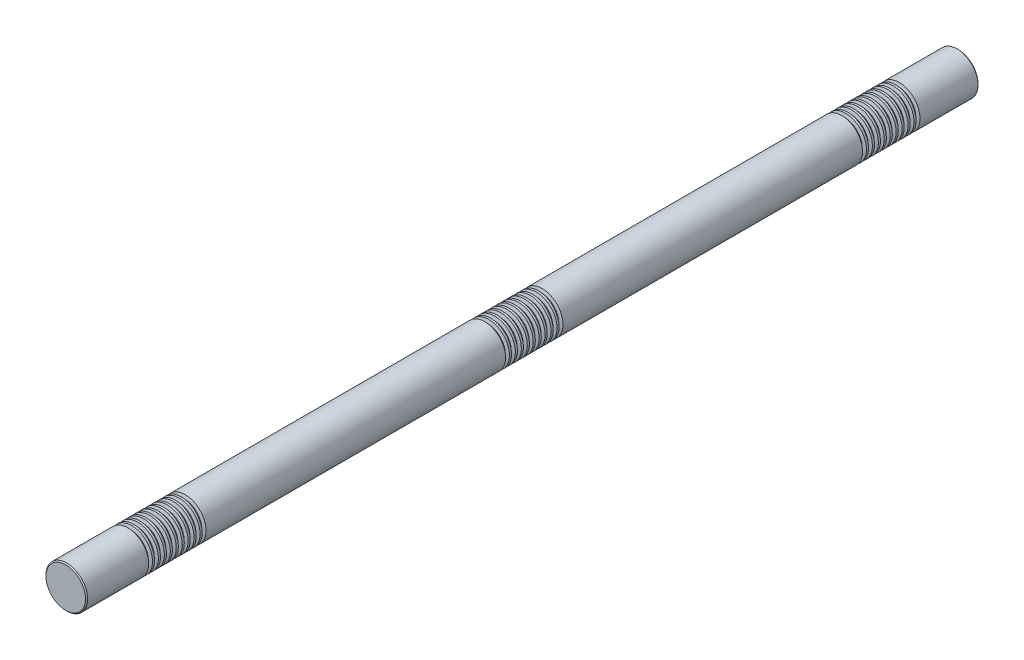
ISO-10303-21;
HEADER;
FILE_DESCRIPTION(('STEP AP214'),'2;1');
FILE_NAME('part.step','',(''),(''),'','','');
FILE_SCHEMA(('AUTOMOTIVE_DESIGN { 1 0 10303 214 1 1 1 1 }'));
ENDSEC;
DATA;
#1=APPLICATION_CONTEXT('core data for automotive mechanical design processes');
#2=APPLICATION_PROTOCOL_DEFINITION('international standard','automotive_design',2000,#1);
#3=PRODUCT_CONTEXT('',#1,'mechanical');
#4=PRODUCT('Part','Part','',(#3));
#5=PRODUCT_RELATED_PRODUCT_CATEGORY('part','',(#4));
#6=PRODUCT_DEFINITION_FORMATION('','',#4);
#7=PRODUCT_DEFINITION_CONTEXT('part definition',#1,'design');
#8=PRODUCT_DEFINITION('design','',#6,#7);
#9=PRODUCT_DEFINITION_SHAPE('','',#8);
#10=(LENGTH_UNIT() NAMED_UNIT(*) SI_UNIT(.MILLI.,.METRE.));
#11=(NAMED_UNIT(*) PLANE_ANGLE_UNIT() SI_UNIT($,.RADIAN.));
#12=(NAMED_UNIT(*) SI_UNIT($,.STERADIAN.) SOLID_ANGLE_UNIT());
#13=UNCERTAINTY_MEASURE_WITH_UNIT(LENGTH_MEASURE(1.E-05),#10,'distance_accuracy_value','');
#14=(GEOMETRIC_REPRESENTATION_CONTEXT(3) GLOBAL_UNCERTAINTY_ASSIGNED_CONTEXT((#13)) GLOBAL_UNIT_ASSIGNED_CONTEXT((#10,
#11,#12)) REPRESENTATION_CONTEXT('',''));
#15=CARTESIAN_POINT('',(0.,0.,0.));
#16=DIRECTION('',(0.,0.,1.));
#17=DIRECTION('',(1.,0.,0.));
#18=AXIS2_PLACEMENT_3D('',#15,#16,#17);
#19=CARTESIAN_POINT('',(0.,0.,750.));
#20=DIRECTION('',(0.,0.,-1.));
#21=DIRECTION('',(-1.,0.,0.));
#22=AXIS2_PLACEMENT_3D('',#19,#20,#21);
#23=CYLINDRICAL_SURFACE('',#22,35.);
#24=CARTESIAN_POINT('',(0.,0.,635.736860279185));
#25=DIRECTION('',(0.,0.,1.));
#26=DIRECTION('',(1.,0.,0.));
#27=AXIS2_PLACEMENT_3D('',#24,#25,#26);
#28=CIRCLE('',#27,35.);
#29=CARTESIAN_POINT('',(35.,0.,635.736860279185));
#30=VERTEX_POINT('',#29);
#31=EDGE_CURVE('E514',#30,#30,#28,.T.);
#32=ORIENTED_EDGE('',*,*,#31,.T.);
#33=EDGE_LOOP('',(#32));
#34=FACE_BOUND('',#33,.T.);
#35=CARTESIAN_POINT('',(0.,0.,639.263139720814));
#36=DIRECTION('',(0.,0.,1.));
#37=DIRECTION('',(1.,0.,0.));
#38=AXIS2_PLACEMENT_3D('',#35,#36,#37);
#39=CIRCLE('',#38,35.);
#40=CARTESIAN_POINT('',(35.,0.,639.263139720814));
#41=VERTEX_POINT('',#40);
#42=EDGE_CURVE('E526',#41,#41,#39,.T.);
#43=ORIENTED_EDGE('',*,*,#42,.F.);
#44=EDGE_LOOP('',(#43));
#45=FACE_BOUND('',#44,.T.);
#46=ADVANCED_FACE('F37',(#34,#45),#23,.T.);
#47=CARTESIAN_POINT('',(0.,0.,625.736860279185));
#48=DIRECTION('',(0.,0.,1.));
#49=DIRECTION('',(1.,0.,0.));
#50=AXIS2_PLACEMENT_3D('',#47,#48,#49);
#51=CIRCLE('',#50,35.);
#52=CARTESIAN_POINT('',(35.,0.,625.736860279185));
#53=VERTEX_POINT('',#52);
#54=EDGE_CURVE('E498',#53,#53,#51,.T.);
#55=ORIENTED_EDGE('',*,*,#54,.T.);
#56=EDGE_LOOP('',(#55));
#57=FACE_BOUND('',#56,.T.);
#58=CARTESIAN_POINT('',(0.,0.,629.263139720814));
#59=DIRECTION('',(0.,0.,1.));
#60=DIRECTION('',(1.,0.,0.));
#61=AXIS2_PLACEMENT_3D('',#58,#59,#60);
#62=CIRCLE('',#61,35.);
#63=CARTESIAN_POINT('',(35.,0.,629.263139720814));
#64=VERTEX_POINT('',#63);
#65=EDGE_CURVE('E510',#64,#64,#62,.T.);
#66=ORIENTED_EDGE('',*,*,#65,.F.);
#67=EDGE_LOOP('',(#66));
#68=FACE_BOUND('',#67,.T.);
#69=ADVANCED_FACE('F561',(#57,#68),#23,.T.);
#70=CARTESIAN_POINT('',(0.,0.,615.736860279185));
#71=DIRECTION('',(0.,0.,1.));
#72=DIRECTION('',(1.,0.,0.));
#73=AXIS2_PLACEMENT_3D('',#70,#71,#72);
#74=CIRCLE('',#73,35.);
#75=CARTESIAN_POINT('',(35.,0.,615.736860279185));
#76=VERTEX_POINT('',#75);
#77=EDGE_CURVE('E482',#76,#76,#74,.T.);
#78=ORIENTED_EDGE('',*,*,#77,.T.);
#79=EDGE_LOOP('',(#78));
#80=FACE_BOUND('',#79,.T.);
#81=CARTESIAN_POINT('',(0.,0.,619.263139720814));
#82=DIRECTION('',(0.,0.,1.));
#83=DIRECTION('',(1.,0.,0.));
#84=AXIS2_PLACEMENT_3D('',#81,#82,#83);
#85=CIRCLE('',#84,35.);
#86=CARTESIAN_POINT('',(35.,0.,619.263139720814));
#87=VERTEX_POINT('',#86);
#88=EDGE_CURVE('E494',#87,#87,#85,.T.);
#89=ORIENTED_EDGE('',*,*,#88,.F.);
#90=EDGE_LOOP('',(#89));
#91=FACE_BOUND('',#90,.T.);
#92=ADVANCED_FACE('F569',(#80,#91),#23,.T.);
#93=CARTESIAN_POINT('',(0.,0.,605.736860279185));
#94=DIRECTION('',(0.,0.,1.));
#95=DIRECTION('',(1.,0.,0.));
#96=AXIS2_PLACEMENT_3D('',#93,#94,#95);
#97=CIRCLE('',#96,35.);
#98=CARTESIAN_POINT('',(35.,0.,605.736860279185));
#99=VERTEX_POINT('',#98);
#100=EDGE_CURVE('E466',#99,#99,#97,.T.);
#101=ORIENTED_EDGE('',*,*,#100,.T.);
#102=EDGE_LOOP('',(#101));
#103=FACE_BOUND('',#102,.T.);
#104=CARTESIAN_POINT('',(0.,0.,609.263139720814));
#105=DIRECTION('',(0.,0.,1.));
#106=DIRECTION('',(1.,0.,0.));
#107=AXIS2_PLACEMENT_3D('',#104,#105,#106);
#108=CIRCLE('',#107,35.);
#109=CARTESIAN_POINT('',(35.,0.,609.263139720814));
#110=VERTEX_POINT('',#109);
#111=EDGE_CURVE('E478',#110,#110,#108,.T.);
#112=ORIENTED_EDGE('',*,*,#111,.F.);
#113=EDGE_LOOP('',(#112));
#114=FACE_BOUND('',#113,.T.);
#115=ADVANCED_FACE('F1162',(#103,#114),#23,.T.);
#116=CARTESIAN_POINT('',(0.,0.,595.736860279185));
#117=DIRECTION('',(0.,0.,1.));
#118=DIRECTION('',(1.,0.,0.));
#119=AXIS2_PLACEMENT_3D('',#116,#117,#118);
#120=CIRCLE('',#119,35.);
#121=CARTESIAN_POINT('',(35.,0.,595.736860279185));
#122=VERTEX_POINT('',#121);
#123=EDGE_CURVE('E450',#122,#122,#120,.T.);
#124=ORIENTED_EDGE('',*,*,#123,.T.);
#125=EDGE_LOOP('',(#124));
#126=FACE_BOUND('',#125,.T.);
#127=CARTESIAN_POINT('',(0.,0.,599.263139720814));
#128=DIRECTION('',(0.,0.,1.));
#129=DIRECTION('',(1.,0.,0.));
#130=AXIS2_PLACEMENT_3D('',#127,#128,#129);
#131=CIRCLE('',#130,35.);
#132=CARTESIAN_POINT('',(35.,0.,599.263139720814));
#133=VERTEX_POINT('',#132);
#134=EDGE_CURVE('E462',#133,#133,#131,.T.);
#135=ORIENTED_EDGE('',*,*,#134,.F.);
#136=EDGE_LOOP('',(#135));
#137=FACE_BOUND('',#136,.T.);
#138=ADVANCED_FACE('F1139',(#126,#137),#23,.T.);
#139=CARTESIAN_POINT('',(0.,0.,585.736860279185));
#140=DIRECTION('',(0.,0.,1.));
#141=DIRECTION('',(1.,0.,0.));
#142=AXIS2_PLACEMENT_3D('',#139,#140,#141);
#143=CIRCLE('',#142,35.);
#144=CARTESIAN_POINT('',(35.,0.,585.736860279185));
#145=VERTEX_POINT('',#144);
#146=EDGE_CURVE('E434',#145,#145,#143,.T.);
#147=ORIENTED_EDGE('',*,*,#146,.T.);
#148=EDGE_LOOP('',(#147));
#149=FACE_BOUND('',#148,.T.);
#150=CARTESIAN_POINT('',(0.,0.,589.263139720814));
#151=DIRECTION('',(0.,0.,1.));
#152=DIRECTION('',(1.,0.,0.));
#153=AXIS2_PLACEMENT_3D('',#150,#151,#152);
#154=CIRCLE('',#153,35.);
#155=CARTESIAN_POINT('',(35.,0.,589.263139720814));
#156=VERTEX_POINT('',#155);
#157=EDGE_CURVE('E446',#156,#156,#154,.T.);
#158=ORIENTED_EDGE('',*,*,#157,.F.);
#159=EDGE_LOOP('',(#158));
#160=FACE_BOUND('',#159,.T.);
#161=ADVANCED_FACE('F1116',(#149,#160),#23,.T.);
#162=CARTESIAN_POINT('',(0.,0.,575.736860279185));
#163=DIRECTION('',(0.,0.,1.));
#164=DIRECTION('',(1.,0.,0.));
#165=AXIS2_PLACEMENT_3D('',#162,#163,#164);
#166=CIRCLE('',#165,35.);
#167=CARTESIAN_POINT('',(35.,0.,575.736860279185));
#168=VERTEX_POINT('',#167);
#169=EDGE_CURVE('E418',#168,#168,#166,.T.);
#170=ORIENTED_EDGE('',*,*,#169,.T.);
#171=EDGE_LOOP('',(#170));
#172=FACE_BOUND('',#171,.T.);
#173=CARTESIAN_POINT('',(0.,0.,579.263139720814));
#174=DIRECTION('',(0.,0.,1.));
#175=DIRECTION('',(1.,0.,0.));
#176=AXIS2_PLACEMENT_3D('',#173,#174,#175);
#177=CIRCLE('',#176,35.);
#178=CARTESIAN_POINT('',(35.,0.,579.263139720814));
#179=VERTEX_POINT('',#178);
#180=EDGE_CURVE('E430',#179,#179,#177,.T.);
#181=ORIENTED_EDGE('',*,*,#180,.F.);
#182=EDGE_LOOP('',(#181));
#183=FACE_BOUND('',#182,.T.);
#184=ADVANCED_FACE('F1093',(#172,#183),#23,.T.);
#185=CARTESIAN_POINT('',(0.,0.,565.736860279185));
#186=DIRECTION('',(0.,0.,1.));
#187=DIRECTION('',(1.,0.,0.));
#188=AXIS2_PLACEMENT_3D('',#185,#186,#187);
#189=CIRCLE('',#188,35.);
#190=CARTESIAN_POINT('',(35.,0.,565.736860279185));
#191=VERTEX_POINT('',#190);
#192=EDGE_CURVE('E402',#191,#191,#189,.T.);
#193=ORIENTED_EDGE('',*,*,#192,.T.);
#194=EDGE_LOOP('',(#193));
#195=FACE_BOUND('',#194,.T.);
#196=CARTESIAN_POINT('',(0.,0.,569.263139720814));
#197=DIRECTION('',(0.,0.,1.));
#198=DIRECTION('',(1.,0.,0.));
#199=AXIS2_PLACEMENT_3D('',#196,#197,#198);
#200=CIRCLE('',#199,35.);
#201=CARTESIAN_POINT('',(35.,0.,569.263139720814));
#202=VERTEX_POINT('',#201);
#203=EDGE_CURVE('E414',#202,#202,#200,.T.);
#204=ORIENTED_EDGE('',*,*,#203,.F.);
#205=EDGE_LOOP('',(#204));
#206=FACE_BOUND('',#205,.T.);
#207=ADVANCED_FACE('F1074',(#195,#206),#23,.T.);
#208=CARTESIAN_POINT('',(0.,0.,555.736860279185));
#209=DIRECTION('',(0.,0.,1.));
#210=DIRECTION('',(1.,0.,0.));
#211=AXIS2_PLACEMENT_3D('',#208,#209,#210);
#212=CIRCLE('',#211,35.);
#213=CARTESIAN_POINT('',(35.,0.,555.736860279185));
#214=VERTEX_POINT('',#213);
#215=EDGE_CURVE('E243',#214,#214,#212,.T.);
#216=ORIENTED_EDGE('',*,*,#215,.T.);
#217=EDGE_LOOP('',(#216));
#218=FACE_BOUND('',#217,.T.);
#219=CARTESIAN_POINT('',(0.,0.,559.263139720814));
#220=DIRECTION('',(0.,0.,1.));
#221=DIRECTION('',(1.,0.,0.));
#222=AXIS2_PLACEMENT_3D('',#219,#220,#221);
#223=CIRCLE('',#222,35.);
#224=CARTESIAN_POINT('',(35.,0.,559.263139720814));
#225=VERTEX_POINT('',#224);
#226=EDGE_CURVE('E398',#225,#225,#223,.T.);
#227=ORIENTED_EDGE('',*,*,#226,.F.);
#228=EDGE_LOOP('',(#227));
#229=FACE_BOUND('',#228,.T.);
#230=ADVANCED_FACE('F1023',(#218,#229),#23,.T.);
#231=CARTESIAN_POINT('',(0.,0.,35.7368602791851));
#232=DIRECTION('',(0.,0.,1.));
#233=DIRECTION('',(1.,0.,0.));
#234=AXIS2_PLACEMENT_3D('',#231,#232,#233);
#235=CIRCLE('',#234,35.);
#236=CARTESIAN_POINT('',(35.,0.,35.7368602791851));
#237=VERTEX_POINT('',#236);
#238=EDGE_CURVE('E370',#237,#237,#235,.T.);
#239=ORIENTED_EDGE('',*,*,#238,.T.);
#240=EDGE_LOOP('',(#239));
#241=FACE_BOUND('',#240,.T.);
#242=CARTESIAN_POINT('',(0.,0.,39.2631397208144));
#243=DIRECTION('',(0.,0.,1.));
#244=DIRECTION('',(1.,0.,0.));
#245=AXIS2_PLACEMENT_3D('',#242,#243,#244);
#246=CIRCLE('',#245,35.);
#247=CARTESIAN_POINT('',(35.,0.,39.2631397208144));
#248=VERTEX_POINT('',#247);
#249=EDGE_CURVE('E382',#248,#248,#246,.T.);
#250=ORIENTED_EDGE('',*,*,#249,.F.);
#251=EDGE_LOOP('',(#250));
#252=FACE_BOUND('',#251,.T.);
#253=ADVANCED_FACE('F999',(#241,#252),#23,.T.);
#254=CARTESIAN_POINT('',(0.,0.,25.7368602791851));
#255=DIRECTION('',(0.,0.,1.));
#256=DIRECTION('',(1.,0.,0.));
#257=AXIS2_PLACEMENT_3D('',#254,#255,#256);
#258=CIRCLE('',#257,35.);
#259=CARTESIAN_POINT('',(35.,0.,25.7368602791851));
#260=VERTEX_POINT('',#259);
#261=EDGE_CURVE('E354',#260,#260,#258,.T.);
#262=ORIENTED_EDGE('',*,*,#261,.T.);
#263=EDGE_LOOP('',(#262));
#264=FACE_BOUND('',#263,.T.);
#265=CARTESIAN_POINT('',(0.,0.,29.2631397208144));
#266=DIRECTION('',(0.,0.,1.));
#267=DIRECTION('',(1.,0.,0.));
#268=AXIS2_PLACEMENT_3D('',#265,#266,#267);
#269=CIRCLE('',#268,35.);
#270=CARTESIAN_POINT('',(35.,0.,29.2631397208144));
#271=VERTEX_POINT('',#270);
#272=EDGE_CURVE('E366',#271,#271,#269,.T.);
#273=ORIENTED_EDGE('',*,*,#272,.F.);
#274=EDGE_LOOP('',(#273));
#275=FACE_BOUND('',#274,.T.);
#276=ADVANCED_FACE('F976',(#264,#275),#23,.T.);
#277=CARTESIAN_POINT('',(0.,0.,15.7368602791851));
#278=DIRECTION('',(0.,0.,1.));
#279=DIRECTION('',(1.,0.,0.));
#280=AXIS2_PLACEMENT_3D('',#277,#278,#279);
#281=CIRCLE('',#280,35.);
#282=CARTESIAN_POINT('',(35.,0.,15.7368602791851));
#283=VERTEX_POINT('',#282);
#284=EDGE_CURVE('E338',#283,#283,#281,.T.);
#285=ORIENTED_EDGE('',*,*,#284,.T.);
#286=EDGE_LOOP('',(#285));
#287=FACE_BOUND('',#286,.T.);
#288=CARTESIAN_POINT('',(0.,0.,19.2631397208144));
#289=DIRECTION('',(0.,0.,1.));
#290=DIRECTION('',(1.,0.,0.));
#291=AXIS2_PLACEMENT_3D('',#288,#289,#290);
#292=CIRCLE('',#291,35.);
#293=CARTESIAN_POINT('',(35.,0.,19.2631397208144));
#294=VERTEX_POINT('',#293);
#295=EDGE_CURVE('E350',#294,#294,#292,.T.);
#296=ORIENTED_EDGE('',*,*,#295,.F.);
#297=EDGE_LOOP('',(#296));
#298=FACE_BOUND('',#297,.T.);
#299=ADVANCED_FACE('F953',(#287,#298),#23,.T.);
#300=CARTESIAN_POINT('',(0.,0.,5.73686027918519));
#301=DIRECTION('',(0.,0.,1.));
#302=DIRECTION('',(1.,0.,0.));
#303=AXIS2_PLACEMENT_3D('',#300,#301,#302);
#304=CIRCLE('',#303,35.);
#305=CARTESIAN_POINT('',(35.,0.,5.73686027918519));
#306=VERTEX_POINT('',#305);
#307=EDGE_CURVE('E322',#306,#306,#304,.T.);
#308=ORIENTED_EDGE('',*,*,#307,.T.);
#309=EDGE_LOOP('',(#308));
#310=FACE_BOUND('',#309,.T.);
#311=CARTESIAN_POINT('',(0.,0.,9.26313972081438));
#312=DIRECTION('',(0.,0.,1.));
#313=DIRECTION('',(1.,0.,0.));
#314=AXIS2_PLACEMENT_3D('',#311,#312,#313);
#315=CIRCLE('',#314,35.);
#316=CARTESIAN_POINT('',(35.,0.,9.26313972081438));
#317=VERTEX_POINT('',#316);
#318=EDGE_CURVE('E334',#317,#317,#315,.T.);
#319=ORIENTED_EDGE('',*,*,#318,.F.);
#320=EDGE_LOOP('',(#319));
#321=FACE_BOUND('',#320,.T.);
#322=ADVANCED_FACE('F930',(#310,#321),#23,.T.);
#323=CARTESIAN_POINT('',(0.,0.,-4.26313972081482));
#324=DIRECTION('',(0.,0.,1.));
#325=DIRECTION('',(1.,0.,0.));
#326=AXIS2_PLACEMENT_3D('',#323,#324,#325);
#327=CIRCLE('',#326,35.);
#328=CARTESIAN_POINT('',(35.,0.,-4.26313972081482));
#329=VERTEX_POINT('',#328);
#330=EDGE_CURVE('E306',#329,#329,#327,.T.);
#331=ORIENTED_EDGE('',*,*,#330,.T.);
#332=EDGE_LOOP('',(#331));
#333=FACE_BOUND('',#332,.T.);
#334=CARTESIAN_POINT('',(0.,0.,-0.736860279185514));
#335=DIRECTION('',(0.,0.,1.));
#336=DIRECTION('',(1.,0.,0.));
#337=AXIS2_PLACEMENT_3D('',#334,#335,#336);
#338=CIRCLE('',#337,35.);
#339=CARTESIAN_POINT('',(35.,0.,-0.736860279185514));
#340=VERTEX_POINT('',#339);
#341=EDGE_CURVE('E318',#340,#340,#338,.T.);
#342=ORIENTED_EDGE('',*,*,#341,.F.);
#343=EDGE_LOOP('',(#342));
#344=FACE_BOUND('',#343,.T.);
#345=ADVANCED_FACE('F907',(#333,#344),#23,.T.);
#346=CARTESIAN_POINT('',(0.,0.,-14.2631397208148));
#347=DIRECTION('',(0.,0.,1.));
#348=DIRECTION('',(1.,0.,0.));
#349=AXIS2_PLACEMENT_3D('',#346,#347,#348);
#350=CIRCLE('',#349,35.);
#351=CARTESIAN_POINT('',(35.,0.,-14.2631397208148));
#352=VERTEX_POINT('',#351);
#353=EDGE_CURVE('E290',#352,#352,#350,.T.);
#354=ORIENTED_EDGE('',*,*,#353,.T.);
#355=EDGE_LOOP('',(#354));
#356=FACE_BOUND('',#355,.T.);
#357=CARTESIAN_POINT('',(0.,0.,-10.7368602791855));
#358=DIRECTION('',(0.,0.,1.));
#359=DIRECTION('',(1.,0.,0.));
#360=AXIS2_PLACEMENT_3D('',#357,#358,#359);
#361=CIRCLE('',#360,35.);
#362=CARTESIAN_POINT('',(35.,0.,-10.7368602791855));
#363=VERTEX_POINT('',#362);
#364=EDGE_CURVE('E302',#363,#363,#361,.T.);
#365=ORIENTED_EDGE('',*,*,#364,.F.);
#366=EDGE_LOOP('',(#365));
#367=FACE_BOUND('',#366,.T.);
#368=ADVANCED_FACE('F884',(#356,#367),#23,.T.);
#369=CARTESIAN_POINT('',(0.,0.,-24.2631397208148));
#370=DIRECTION('',(0.,0.,1.));
#371=DIRECTION('',(1.,0.,0.));
#372=AXIS2_PLACEMENT_3D('',#369,#370,#371);
#373=CIRCLE('',#372,35.);
#374=CARTESIAN_POINT('',(35.,0.,-24.2631397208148));
#375=VERTEX_POINT('',#374);
#376=EDGE_CURVE('E274',#375,#375,#373,.T.);
#377=ORIENTED_EDGE('',*,*,#376,.T.);
#378=EDGE_LOOP('',(#377));
#379=FACE_BOUND('',#378,.T.);
#380=CARTESIAN_POINT('',(0.,0.,-20.7368602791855));
#381=DIRECTION('',(0.,0.,1.));
#382=DIRECTION('',(1.,0.,0.));
#383=AXIS2_PLACEMENT_3D('',#380,#381,#382);
#384=CIRCLE('',#383,35.);
#385=CARTESIAN_POINT('',(35.,0.,-20.7368602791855));
#386=VERTEX_POINT('',#385);
#387=EDGE_CURVE('E286',#386,#386,#384,.T.);
#388=ORIENTED_EDGE('',*,*,#387,.F.);
#389=EDGE_LOOP('',(#388));
#390=FACE_BOUND('',#389,.T.);
#391=ADVANCED_FACE('F861',(#379,#390),#23,.T.);
#392=CARTESIAN_POINT('',(0.,0.,-34.2631397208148));
#393=DIRECTION('',(0.,0.,1.));
#394=DIRECTION('',(1.,0.,0.));
#395=AXIS2_PLACEMENT_3D('',#392,#393,#394);
#396=CIRCLE('',#395,35.);
#397=CARTESIAN_POINT('',(35.,0.,-34.2631397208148));
#398=VERTEX_POINT('',#397);
#399=EDGE_CURVE('E259',#398,#398,#396,.T.);
#400=ORIENTED_EDGE('',*,*,#399,.T.);
#401=EDGE_LOOP('',(#400));
#402=FACE_BOUND('',#401,.T.);
#403=CARTESIAN_POINT('',(0.,0.,-30.7368602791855));
#404=DIRECTION('',(0.,0.,1.));
#405=DIRECTION('',(1.,0.,0.));
#406=AXIS2_PLACEMENT_3D('',#403,#404,#405);
#407=CIRCLE('',#406,35.);
#408=CARTESIAN_POINT('',(35.,0.,-30.7368602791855));
#409=VERTEX_POINT('',#408);
#410=EDGE_CURVE('E270',#409,#409,#407,.T.);
#411=ORIENTED_EDGE('',*,*,#410,.F.);
#412=EDGE_LOOP('',(#411));
#413=FACE_BOUND('',#412,.T.);
#414=ADVANCED_FACE('F838',(#402,#413),#23,.T.);
#415=CARTESIAN_POINT('',(0.,0.,-44.2631397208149));
#416=DIRECTION('',(0.,0.,1.));
#417=DIRECTION('',(1.,0.,0.));
#418=AXIS2_PLACEMENT_3D('',#415,#416,#417);
#419=CIRCLE('',#418,35.);
#420=CARTESIAN_POINT('',(35.,0.,-44.2631397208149));
#421=VERTEX_POINT('',#420);
#422=EDGE_CURVE('E228',#421,#421,#419,.T.);
#423=ORIENTED_EDGE('',*,*,#422,.T.);
#424=EDGE_LOOP('',(#423));
#425=FACE_BOUND('',#424,.T.);
#426=CARTESIAN_POINT('',(0.,0.,-40.7368602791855));
#427=DIRECTION('',(0.,0.,1.));
#428=DIRECTION('',(1.,0.,0.));
#429=AXIS2_PLACEMENT_3D('',#426,#427,#428);
#430=CIRCLE('',#429,35.);
#431=CARTESIAN_POINT('',(35.,0.,-40.7368602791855));
#432=VERTEX_POINT('',#431);
#433=EDGE_CURVE('E255',#432,#432,#430,.T.);
#434=ORIENTED_EDGE('',*,*,#433,.F.);
#435=EDGE_LOOP('',(#434));
#436=FACE_BOUND('',#435,.T.);
#437=ADVANCED_FACE('F815',(#425,#436),#23,.T.);
#438=CARTESIAN_POINT('',(0.,0.,-554.263139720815));
#439=DIRECTION('',(0.,0.,1.));
#440=DIRECTION('',(1.,0.,0.));
#441=AXIS2_PLACEMENT_3D('',#438,#439,#440);
#442=CIRCLE('',#441,35.);
#443=CARTESIAN_POINT('',(35.,0.,-554.263139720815));
#444=VERTEX_POINT('',#443);
#445=EDGE_CURVE('E212',#444,#444,#442,.T.);
#446=ORIENTED_EDGE('',*,*,#445,.T.);
#447=EDGE_LOOP('',(#446));
#448=FACE_BOUND('',#447,.T.);
#449=CARTESIAN_POINT('',(0.,0.,-50.7368602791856));
#450=DIRECTION('',(0.,0.,1.));
#451=DIRECTION('',(1.,0.,0.));
#452=AXIS2_PLACEMENT_3D('',#449,#450,#451);
#453=CIRCLE('',#452,35.);
#454=CARTESIAN_POINT('',(35.,0.,-50.7368602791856));
#455=VERTEX_POINT('',#454);
#456=EDGE_CURVE('E224',#455,#455,#453,.T.);
#457=ORIENTED_EDGE('',*,*,#456,.F.);
#458=EDGE_LOOP('',(#457));
#459=FACE_BOUND('',#458,.T.);
#460=ADVANCED_FACE('F792',(#448,#459),#23,.T.);
#461=CARTESIAN_POINT('',(0.,0.,-564.263139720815));
#462=DIRECTION('',(0.,0.,1.));
#463=DIRECTION('',(1.,0.,0.));
#464=AXIS2_PLACEMENT_3D('',#461,#462,#463);
#465=CIRCLE('',#464,35.);
#466=CARTESIAN_POINT('',(35.,0.,-564.263139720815));
#467=VERTEX_POINT('',#466);
#468=EDGE_CURVE('E196',#467,#467,#465,.T.);
#469=ORIENTED_EDGE('',*,*,#468,.T.);
#470=EDGE_LOOP('',(#469));
#471=FACE_BOUND('',#470,.T.);
#472=CARTESIAN_POINT('',(0.,0.,-560.736860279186));
#473=DIRECTION('',(0.,0.,1.));
#474=DIRECTION('',(1.,0.,0.));
#475=AXIS2_PLACEMENT_3D('',#472,#473,#474);
#476=CIRCLE('',#475,35.);
#477=CARTESIAN_POINT('',(35.,0.,-560.736860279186));
#478=VERTEX_POINT('',#477);
#479=EDGE_CURVE('E208',#478,#478,#476,.T.);
#480=ORIENTED_EDGE('',*,*,#479,.F.);
#481=EDGE_LOOP('',(#480));
#482=FACE_BOUND('',#481,.T.);
#483=ADVANCED_FACE('F769',(#471,#482),#23,.T.);
#484=CARTESIAN_POINT('',(0.,0.,-574.263139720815));
#485=DIRECTION('',(0.,0.,1.));
#486=DIRECTION('',(1.,0.,0.));
#487=AXIS2_PLACEMENT_3D('',#484,#485,#486);
#488=CIRCLE('',#487,35.);
#489=CARTESIAN_POINT('',(35.,0.,-574.263139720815));
#490=VERTEX_POINT('',#489);
#491=EDGE_CURVE('E180',#490,#490,#488,.T.);
#492=ORIENTED_EDGE('',*,*,#491,.T.);
#493=EDGE_LOOP('',(#492));
#494=FACE_BOUND('',#493,.T.);
#495=CARTESIAN_POINT('',(0.,0.,-570.736860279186));
#496=DIRECTION('',(0.,0.,1.));
#497=DIRECTION('',(1.,0.,0.));
#498=AXIS2_PLACEMENT_3D('',#495,#496,#497);
#499=CIRCLE('',#498,35.);
#500=CARTESIAN_POINT('',(35.,0.,-570.736860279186));
#501=VERTEX_POINT('',#500);
#502=EDGE_CURVE('E192',#501,#501,#499,.T.);
#503=ORIENTED_EDGE('',*,*,#502,.F.);
#504=EDGE_LOOP('',(#503));
#505=FACE_BOUND('',#504,.T.);
#506=ADVANCED_FACE('F746',(#494,#505),#23,.T.);
#507=CARTESIAN_POINT('',(0.,0.,-584.263139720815));
#508=DIRECTION('',(0.,0.,1.));
#509=DIRECTION('',(1.,0.,0.));
#510=AXIS2_PLACEMENT_3D('',#507,#508,#509);
#511=CIRCLE('',#510,35.);
#512=CARTESIAN_POINT('',(35.,0.,-584.263139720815));
#513=VERTEX_POINT('',#512);
#514=EDGE_CURVE('E164',#513,#513,#511,.T.);
#515=ORIENTED_EDGE('',*,*,#514,.T.);
#516=EDGE_LOOP('',(#515));
#517=FACE_BOUND('',#516,.T.);
#518=CARTESIAN_POINT('',(0.,0.,-580.736860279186));
#519=DIRECTION('',(0.,0.,1.));
#520=DIRECTION('',(1.,0.,0.));
#521=AXIS2_PLACEMENT_3D('',#518,#519,#520);
#522=CIRCLE('',#521,35.);
#523=CARTESIAN_POINT('',(35.,0.,-580.736860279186));
#524=VERTEX_POINT('',#523);
#525=EDGE_CURVE('E176',#524,#524,#522,.T.);
#526=ORIENTED_EDGE('',*,*,#525,.F.);
#527=EDGE_LOOP('',(#526));
#528=FACE_BOUND('',#527,.T.);
#529=ADVANCED_FACE('F723',(#517,#528),#23,.T.);
#530=CARTESIAN_POINT('',(0.,0.,-594.263139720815));
#531=DIRECTION('',(0.,0.,1.));
#532=DIRECTION('',(1.,0.,0.));
#533=AXIS2_PLACEMENT_3D('',#530,#531,#532);
#534=CIRCLE('',#533,35.);
#535=CARTESIAN_POINT('',(35.,0.,-594.263139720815));
#536=VERTEX_POINT('',#535);
#537=EDGE_CURVE('E148',#536,#536,#534,.T.);
#538=ORIENTED_EDGE('',*,*,#537,.T.);
#539=EDGE_LOOP('',(#538));
#540=FACE_BOUND('',#539,.T.);
#541=CARTESIAN_POINT('',(0.,0.,-590.736860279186));
#542=DIRECTION('',(0.,0.,1.));
#543=DIRECTION('',(1.,0.,0.));
#544=AXIS2_PLACEMENT_3D('',#541,#542,#543);
#545=CIRCLE('',#544,35.);
#546=CARTESIAN_POINT('',(35.,0.,-590.736860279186));
#547=VERTEX_POINT('',#546);
#548=EDGE_CURVE('E160',#547,#547,#545,.T.);
#549=ORIENTED_EDGE('',*,*,#548,.F.);
#550=EDGE_LOOP('',(#549));
#551=FACE_BOUND('',#550,.T.);
#552=ADVANCED_FACE('F700',(#540,#551),#23,.T.);
#553=CARTESIAN_POINT('',(0.,0.,-604.263139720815));
#554=DIRECTION('',(0.,0.,1.));
#555=DIRECTION('',(1.,0.,0.));
#556=AXIS2_PLACEMENT_3D('',#553,#554,#555);
#557=CIRCLE('',#556,35.);
#558=CARTESIAN_POINT('',(35.,0.,-604.263139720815));
#559=VERTEX_POINT('',#558);
#560=EDGE_CURVE('E132',#559,#559,#557,.T.);
#561=ORIENTED_EDGE('',*,*,#560,.T.);
#562=EDGE_LOOP('',(#561));
#563=FACE_BOUND('',#562,.T.);
#564=CARTESIAN_POINT('',(0.,0.,-600.736860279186));
#565=DIRECTION('',(0.,0.,1.));
#566=DIRECTION('',(1.,0.,0.));
#567=AXIS2_PLACEMENT_3D('',#564,#565,#566);
#568=CIRCLE('',#567,35.);
#569=CARTESIAN_POINT('',(35.,0.,-600.736860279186));
#570=VERTEX_POINT('',#569);
#571=EDGE_CURVE('E144',#570,#570,#568,.T.);
#572=ORIENTED_EDGE('',*,*,#571,.F.);
#573=EDGE_LOOP('',(#572));
#574=FACE_BOUND('',#573,.T.);
#575=ADVANCED_FACE('F677',(#563,#574),#23,.T.);
#576=CARTESIAN_POINT('',(0.,0.,-614.263139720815));
#577=DIRECTION('',(0.,0.,1.));
#578=DIRECTION('',(1.,0.,0.));
#579=AXIS2_PLACEMENT_3D('',#576,#577,#578);
#580=CIRCLE('',#579,35.);
#581=CARTESIAN_POINT('',(35.,0.,-614.263139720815));
#582=VERTEX_POINT('',#581);
#583=EDGE_CURVE('E116',#582,#582,#580,.T.);
#584=ORIENTED_EDGE('',*,*,#583,.T.);
#585=EDGE_LOOP('',(#584));
#586=FACE_BOUND('',#585,.T.);
#587=CARTESIAN_POINT('',(0.,0.,-610.736860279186));
#588=DIRECTION('',(0.,0.,1.));
#589=DIRECTION('',(1.,0.,0.));
#590=AXIS2_PLACEMENT_3D('',#587,#588,#589);
#591=CIRCLE('',#590,35.);
#592=CARTESIAN_POINT('',(35.,0.,-610.736860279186));
#593=VERTEX_POINT('',#592);
#594=EDGE_CURVE('E128',#593,#593,#591,.T.);
#595=ORIENTED_EDGE('',*,*,#594,.F.);
#596=EDGE_LOOP('',(#595));
#597=FACE_BOUND('',#596,.T.);
#598=ADVANCED_FACE('F654',(#586,#597),#23,.T.);
#599=CARTESIAN_POINT('',(0.,0.,-624.263139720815));
#600=DIRECTION('',(0.,0.,1.));
#601=DIRECTION('',(1.,0.,0.));
#602=AXIS2_PLACEMENT_3D('',#599,#600,#601);
#603=CIRCLE('',#602,35.);
#604=CARTESIAN_POINT('',(35.,0.,-624.263139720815));
#605=VERTEX_POINT('',#604);
#606=EDGE_CURVE('E100',#605,#605,#603,.T.);
#607=ORIENTED_EDGE('',*,*,#606,.T.);
#608=EDGE_LOOP('',(#607));
#609=FACE_BOUND('',#608,.T.);
#610=CARTESIAN_POINT('',(0.,0.,-620.736860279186));
#611=DIRECTION('',(0.,0.,1.));
#612=DIRECTION('',(1.,0.,0.));
#613=AXIS2_PLACEMENT_3D('',#610,#611,#612);
#614=CIRCLE('',#613,35.);
#615=CARTESIAN_POINT('',(35.,0.,-620.736860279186));
#616=VERTEX_POINT('',#615);
#617=EDGE_CURVE('E112',#616,#616,#614,.T.);
#618=ORIENTED_EDGE('',*,*,#617,.F.);
#619=EDGE_LOOP('',(#618));
#620=FACE_BOUND('',#619,.T.);
#621=ADVANCED_FACE('F631',(#609,#620),#23,.T.);
#622=CARTESIAN_POINT('',(0.,0.,-634.263139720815));
#623=DIRECTION('',(0.,0.,1.));
#624=DIRECTION('',(1.,0.,0.));
#625=AXIS2_PLACEMENT_3D('',#622,#623,#624);
#626=CIRCLE('',#625,35.);
#627=CARTESIAN_POINT('',(35.,0.,-634.263139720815));
#628=VERTEX_POINT('',#627);
#629=EDGE_CURVE('E85',#628,#628,#626,.T.);
#630=ORIENTED_EDGE('',*,*,#629,.T.);
#631=EDGE_LOOP('',(#630));
#632=FACE_BOUND('',#631,.T.);
#633=CARTESIAN_POINT('',(0.,0.,-630.736860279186));
#634=DIRECTION('',(0.,0.,1.));
#635=DIRECTION('',(1.,0.,0.));
#636=AXIS2_PLACEMENT_3D('',#633,#634,#635);
#637=CIRCLE('',#636,35.);
#638=CARTESIAN_POINT('',(35.,0.,-630.736860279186));
#639=VERTEX_POINT('',#638);
#640=EDGE_CURVE('E97',#639,#639,#637,.T.);
#641=ORIENTED_EDGE('',*,*,#640,.F.);
#642=EDGE_LOOP('',(#641));
#643=FACE_BOUND('',#642,.T.);
#644=ADVANCED_FACE('F584',(#632,#643),#23,.T.);
#645=CARTESIAN_POINT('',(0.,0.,-644.263139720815));
#646=DIRECTION('',(0.,0.,1.));
#647=DIRECTION('',(1.,0.,0.));
#648=AXIS2_PLACEMENT_3D('',#645,#646,#647);
#649=CIRCLE('',#648,35.);
#650=CARTESIAN_POINT('',(35.,0.,-644.263139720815));
#651=VERTEX_POINT('',#650);
#652=EDGE_CURVE('E69',#651,#651,#649,.T.);
#653=ORIENTED_EDGE('',*,*,#652,.T.);
#654=EDGE_LOOP('',(#653));
#655=FACE_BOUND('',#654,.T.);
#656=CARTESIAN_POINT('',(0.,0.,-640.736860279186));
#657=DIRECTION('',(0.,0.,1.));
#658=DIRECTION('',(1.,0.,0.));
#659=AXIS2_PLACEMENT_3D('',#656,#657,#658);
#660=CIRCLE('',#659,35.);
#661=CARTESIAN_POINT('',(35.,0.,-640.736860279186));
#662=VERTEX_POINT('',#661);
#663=EDGE_CURVE('E81',#662,#662,#660,.T.);
#664=ORIENTED_EDGE('',*,*,#663,.F.);
#665=EDGE_LOOP('',(#664));
#666=FACE_BOUND('',#665,.T.);
#667=ADVANCED_FACE('F577',(#655,#666),#23,.T.);
#668=CARTESIAN_POINT('',(0.,0.,-748.25));
#669=DIRECTION('',(0.,0.,1.));
#670=DIRECTION('',(1.,0.,0.));
#671=AXIS2_PLACEMENT_3D('',#668,#669,#670);
#672=CIRCLE('',#671,35.);
#673=CARTESIAN_POINT('',(35.,0.,-748.25));
#674=VERTEX_POINT('',#673);
#675=EDGE_CURVE('E52',#674,#674,#672,.T.);
#676=ORIENTED_EDGE('',*,*,#675,.T.);
#677=EDGE_LOOP('',(#676));
#678=FACE_BOUND('',#677,.T.);
#679=CARTESIAN_POINT('',(0.,0.,-650.736860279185));
#680=DIRECTION('',(0.,0.,1.));
#681=DIRECTION('',(1.,0.,0.));
#682=AXIS2_PLACEMENT_3D('',#679,#680,#681);
#683=CIRCLE('',#682,35.);
#684=CARTESIAN_POINT('',(35.,0.,-650.736860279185));
#685=VERTEX_POINT('',#684);
#686=EDGE_CURVE('E65',#685,#685,#683,.T.);
#687=ORIENTED_EDGE('',*,*,#686,.F.);
#688=EDGE_LOOP('',(#687));
#689=FACE_BOUND('',#688,.T.);
#690=ADVANCED_FACE('F565',(#678,#689),#23,.T.);
#691=CARTESIAN_POINT('',(0.,0.,-750.));
#692=DIRECTION('',(0.,0.,1.));
#693=DIRECTION('',(1.,0.,0.));
#694=AXIS2_PLACEMENT_3D('',#691,#692,#693);
#695=PLANE('',#694);
#696=CARTESIAN_POINT('',(0.,0.,-750.));
#697=DIRECTION('',(0.,0.,1.));
#698=DIRECTION('',(1.,0.,0.));
#699=AXIS2_PLACEMENT_3D('',#696,#697,#698);
#700=CIRCLE('',#699,33.2500000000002);
#701=CARTESIAN_POINT('',(33.2500000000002,0.,-750.));
#702=VERTEX_POINT('',#701);
#703=EDGE_CURVE('E45',#702,#702,#700,.F.);
#704=ORIENTED_EDGE('',*,*,#703,.T.);
#705=EDGE_LOOP('',(#704));
#706=FACE_BOUND('',#705,.T.);
#707=ADVANCED_FACE('F576',(#706),#695,.F.);
#708=CARTESIAN_POINT('',(0.,0.,-748.25));
#709=DIRECTION('',(0.,0.,1.));
#710=DIRECTION('',(1.,0.,0.));
#711=AXIS2_PLACEMENT_3D('',#708,#709,#710);
#712=CONICAL_SURFACE('',#711,35.,0.785398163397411);
#713=ORIENTED_EDGE('',*,*,#703,.F.);
#714=EDGE_LOOP('',(#713));
#715=FACE_BOUND('',#714,.T.);
#716=ORIENTED_EDGE('',*,*,#675,.F.);
#717=EDGE_LOOP('',(#716));
#718=FACE_BOUND('',#717,.T.);
#719=ADVANCED_FACE('F583',(#715,#718),#712,.T.);
#720=CARTESIAN_POINT('',(0.,0.,-649.263139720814));
#721=DIRECTION('',(0.,0.,-1.));
#722=DIRECTION('',(-1.,0.,0.));
#723=AXIS2_PLACEMENT_3D('',#720,#721,#722);
#724=CONICAL_SURFACE('',#723,29.5,1.30899693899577);
#725=ORIENTED_EDGE('',*,*,#686,.T.);
#726=EDGE_LOOP('',(#725));
#727=FACE_BOUND('',#726,.T.);
#728=CARTESIAN_POINT('',(0.,0.,-649.263139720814));
#729=DIRECTION('',(0.,0.,1.));
#730=DIRECTION('',(1.,0.,0.));
#731=AXIS2_PLACEMENT_3D('',#728,#729,#730);
#732=CIRCLE('',#731,29.5);
#733=CARTESIAN_POINT('',(29.5,0.,-649.263139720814));
#734=VERTEX_POINT('',#733);
#735=EDGE_CURVE('E77',#734,#734,#732,.T.);
#736=ORIENTED_EDGE('',*,*,#735,.F.);
#737=EDGE_LOOP('',(#736));
#738=FACE_BOUND('',#737,.T.);
#739=ADVANCED_FACE('F590',(#727,#738),#724,.T.);
#740=CARTESIAN_POINT('',(0.,0.,-644.263139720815));
#741=DIRECTION('',(0.,0.,1.));
#742=DIRECTION('',(1.,0.,0.));
#743=AXIS2_PLACEMENT_3D('',#740,#741,#742);
#744=CONICAL_SURFACE('',#743,35.,1.30899693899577);
#745=CARTESIAN_POINT('',(0.,0.,-645.736860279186));
#746=DIRECTION('',(0.,0.,1.));
#747=DIRECTION('',(1.,0.,0.));
#748=AXIS2_PLACEMENT_3D('',#745,#746,#747);
#749=CIRCLE('',#748,29.5);
#750=CARTESIAN_POINT('',(29.5,0.,-645.736860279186));
#751=VERTEX_POINT('',#750);
#752=EDGE_CURVE('E73',#751,#751,#749,.T.);
#753=ORIENTED_EDGE('',*,*,#752,.T.);
#754=EDGE_LOOP('',(#753));
#755=FACE_BOUND('',#754,.T.);
#756=ORIENTED_EDGE('',*,*,#652,.F.);
#757=EDGE_LOOP('',(#756));
#758=FACE_BOUND('',#757,.T.);
#759=ADVANCED_FACE('F593',(#755,#758),#744,.T.);
#760=CARTESIAN_POINT('',(0.,0.,748.25));
#761=DIRECTION('',(0.,0.,1.));
#762=DIRECTION('',(1.,0.,0.));
#763=AXIS2_PLACEMENT_3D('',#760,#761,#762);
#764=CYLINDRICAL_SURFACE('',#763,29.5);
#765=ORIENTED_EDGE('',*,*,#735,.T.);
#766=EDGE_LOOP('',(#765));
#767=FACE_BOUND('',#766,.T.);
#768=ORIENTED_EDGE('',*,*,#752,.F.);
#769=EDGE_LOOP('',(#768));
#770=FACE_BOUND('',#769,.T.);
#771=ADVANCED_FACE('F597',(#767,#770),#764,.T.);
#772=CARTESIAN_POINT('',(0.,0.,-639.263139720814));
#773=DIRECTION('',(0.,0.,-1.));
#774=DIRECTION('',(-1.,0.,0.));
#775=AXIS2_PLACEMENT_3D('',#772,#773,#774);
#776=CONICAL_SURFACE('',#775,29.5,1.30899693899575);
#777=ORIENTED_EDGE('',*,*,#663,.T.);
#778=EDGE_LOOP('',(#777));
#779=FACE_BOUND('',#778,.T.);
#780=CARTESIAN_POINT('',(0.,0.,-639.263139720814));
#781=DIRECTION('',(0.,0.,1.));
#782=DIRECTION('',(1.,0.,0.));
#783=AXIS2_PLACEMENT_3D('',#780,#781,#782);
#784=CIRCLE('',#783,29.5);
#785=CARTESIAN_POINT('',(29.5,0.,-639.263139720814));
#786=VERTEX_POINT('',#785);
#787=EDGE_CURVE('E93',#786,#786,#784,.T.);
#788=ORIENTED_EDGE('',*,*,#787,.F.);
#789=EDGE_LOOP('',(#788));
#790=FACE_BOUND('',#789,.T.);
#791=ADVANCED_FACE('F600',(#779,#790),#776,.T.);
#792=CARTESIAN_POINT('',(0.,0.,-634.263139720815));
#793=DIRECTION('',(0.,0.,1.));
#794=DIRECTION('',(1.,0.,0.));
#795=AXIS2_PLACEMENT_3D('',#792,#793,#794);
#796=CONICAL_SURFACE('',#795,35.,1.30899693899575);
#797=CARTESIAN_POINT('',(0.,0.,-635.736860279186));
#798=DIRECTION('',(0.,0.,1.));
#799=DIRECTION('',(1.,0.,0.));
#800=AXIS2_PLACEMENT_3D('',#797,#798,#799);
#801=CIRCLE('',#800,29.5);
#802=CARTESIAN_POINT('',(29.5,0.,-635.736860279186));
#803=VERTEX_POINT('',#802);
#804=EDGE_CURVE('E89',#803,#803,#801,.T.);
#805=ORIENTED_EDGE('',*,*,#804,.T.);
#806=EDGE_LOOP('',(#805));
#807=FACE_BOUND('',#806,.T.);
#808=ORIENTED_EDGE('',*,*,#629,.F.);
#809=EDGE_LOOP('',(#808));
#810=FACE_BOUND('',#809,.T.);
#811=ADVANCED_FACE('F613',(#807,#810),#796,.T.);
#812=CARTESIAN_POINT('',(0.,0.,-640.736860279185));
#813=DIRECTION('',(0.,0.,1.));
#814=DIRECTION('',(1.,0.,0.));
#815=AXIS2_PLACEMENT_3D('',#812,#813,#814);
#816=CYLINDRICAL_SURFACE('',#815,29.5);
#817=ORIENTED_EDGE('',*,*,#787,.T.);
#818=EDGE_LOOP('',(#817));
#819=FACE_BOUND('',#818,.T.);
#820=ORIENTED_EDGE('',*,*,#804,.F.);
#821=EDGE_LOOP('',(#820));
#822=FACE_BOUND('',#821,.T.);
#823=ADVANCED_FACE('F617',(#819,#822),#816,.T.);
#824=CARTESIAN_POINT('',(0.,0.,-629.263139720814));
#825=DIRECTION('',(0.,0.,-1.));
#826=DIRECTION('',(-1.,0.,0.));
#827=AXIS2_PLACEMENT_3D('',#824,#825,#826);
#828=CONICAL_SURFACE('',#827,29.5,1.30899693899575);
#829=ORIENTED_EDGE('',*,*,#640,.T.);
#830=EDGE_LOOP('',(#829));
#831=FACE_BOUND('',#830,.T.);
#832=CARTESIAN_POINT('',(0.,0.,-629.263139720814));
#833=DIRECTION('',(0.,0.,1.));
#834=DIRECTION('',(1.,0.,0.));
#835=AXIS2_PLACEMENT_3D('',#832,#833,#834);
#836=CIRCLE('',#835,29.5);
#837=CARTESIAN_POINT('',(29.5,0.,-629.263139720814));
#838=VERTEX_POINT('',#837);
#839=EDGE_CURVE('E108',#838,#838,#836,.T.);
#840=ORIENTED_EDGE('',*,*,#839,.F.);
#841=EDGE_LOOP('',(#840));
#842=FACE_BOUND('',#841,.T.);
#843=ADVANCED_FACE('F620',(#831,#842),#828,.T.);
#844=CARTESIAN_POINT('',(0.,0.,-624.263139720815));
#845=DIRECTION('',(0.,0.,1.));
#846=DIRECTION('',(1.,0.,0.));
#847=AXIS2_PLACEMENT_3D('',#844,#845,#846);
#848=CONICAL_SURFACE('',#847,35.,1.30899693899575);
#849=CARTESIAN_POINT('',(0.,0.,-625.736860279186));
#850=DIRECTION('',(0.,0.,1.));
#851=DIRECTION('',(1.,0.,0.));
#852=AXIS2_PLACEMENT_3D('',#849,#850,#851);
#853=CIRCLE('',#852,29.5);
#854=CARTESIAN_POINT('',(29.5,0.,-625.736860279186));
#855=VERTEX_POINT('',#854);
#856=EDGE_CURVE('E104',#855,#855,#853,.T.);
#857=ORIENTED_EDGE('',*,*,#856,.T.);
#858=EDGE_LOOP('',(#857));
#859=FACE_BOUND('',#858,.T.);
#860=ORIENTED_EDGE('',*,*,#606,.F.);
#861=EDGE_LOOP('',(#860));
#862=FACE_BOUND('',#861,.T.);
#863=ADVANCED_FACE('F636',(#859,#862),#848,.T.);
#864=CARTESIAN_POINT('',(0.,0.,-630.736860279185));
#865=DIRECTION('',(0.,0.,1.));
#866=DIRECTION('',(1.,0.,0.));
#867=AXIS2_PLACEMENT_3D('',#864,#865,#866);
#868=CYLINDRICAL_SURFACE('',#867,29.5);
#869=ORIENTED_EDGE('',*,*,#839,.T.);
#870=EDGE_LOOP('',(#869));
#871=FACE_BOUND('',#870,.T.);
#872=ORIENTED_EDGE('',*,*,#856,.F.);
#873=EDGE_LOOP('',(#872));
#874=FACE_BOUND('',#873,.T.);
#875=ADVANCED_FACE('F640',(#871,#874),#868,.T.);
#876=CARTESIAN_POINT('',(0.,0.,-619.263139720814));
#877=DIRECTION('',(0.,0.,-1.));
#878=DIRECTION('',(-1.,0.,0.));
#879=AXIS2_PLACEMENT_3D('',#876,#877,#878);
#880=CONICAL_SURFACE('',#879,29.5,1.30899693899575);
#881=ORIENTED_EDGE('',*,*,#617,.T.);
#882=EDGE_LOOP('',(#881));
#883=FACE_BOUND('',#882,.T.);
#884=CARTESIAN_POINT('',(0.,0.,-619.263139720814));
#885=DIRECTION('',(0.,0.,1.));
#886=DIRECTION('',(1.,0.,0.));
#887=AXIS2_PLACEMENT_3D('',#884,#885,#886);
#888=CIRCLE('',#887,29.5);
#889=CARTESIAN_POINT('',(29.5,0.,-619.263139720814));
#890=VERTEX_POINT('',#889);
#891=EDGE_CURVE('E124',#890,#890,#888,.T.);
#892=ORIENTED_EDGE('',*,*,#891,.F.);
#893=EDGE_LOOP('',(#892));
#894=FACE_BOUND('',#893,.T.);
#895=ADVANCED_FACE('F643',(#883,#894),#880,.T.);
#896=CARTESIAN_POINT('',(0.,0.,-614.263139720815));
#897=DIRECTION('',(0.,0.,1.));
#898=DIRECTION('',(1.,0.,0.));
#899=AXIS2_PLACEMENT_3D('',#896,#897,#898);
#900=CONICAL_SURFACE('',#899,35.,1.30899693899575);
#901=CARTESIAN_POINT('',(0.,0.,-615.736860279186));
#902=DIRECTION('',(0.,0.,1.));
#903=DIRECTION('',(1.,0.,0.));
#904=AXIS2_PLACEMENT_3D('',#901,#902,#903);
#905=CIRCLE('',#904,29.5);
#906=CARTESIAN_POINT('',(29.5,0.,-615.736860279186));
#907=VERTEX_POINT('',#906);
#908=EDGE_CURVE('E120',#907,#907,#905,.T.);
#909=ORIENTED_EDGE('',*,*,#908,.T.);
#910=EDGE_LOOP('',(#909));
#911=FACE_BOUND('',#910,.T.);
#912=ORIENTED_EDGE('',*,*,#583,.F.);
#913=EDGE_LOOP('',(#912));
#914=FACE_BOUND('',#913,.T.);
#915=ADVANCED_FACE('F659',(#911,#914),#900,.T.);
#916=CARTESIAN_POINT('',(0.,0.,-620.736860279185));
#917=DIRECTION('',(0.,0.,1.));
#918=DIRECTION('',(1.,0.,0.));
#919=AXIS2_PLACEMENT_3D('',#916,#917,#918);
#920=CYLINDRICAL_SURFACE('',#919,29.5);
#921=ORIENTED_EDGE('',*,*,#891,.T.);
#922=EDGE_LOOP('',(#921));
#923=FACE_BOUND('',#922,.T.);
#924=ORIENTED_EDGE('',*,*,#908,.F.);
#925=EDGE_LOOP('',(#924));
#926=FACE_BOUND('',#925,.T.);
#927=ADVANCED_FACE('F663',(#923,#926),#920,.T.);
#928=CARTESIAN_POINT('',(0.,0.,-609.263139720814));
#929=DIRECTION('',(0.,0.,-1.));
#930=DIRECTION('',(-1.,0.,0.));
#931=AXIS2_PLACEMENT_3D('',#928,#929,#930);
#932=CONICAL_SURFACE('',#931,29.5,1.30899693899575);
#933=ORIENTED_EDGE('',*,*,#594,.T.);
#934=EDGE_LOOP('',(#933));
#935=FACE_BOUND('',#934,.T.);
#936=CARTESIAN_POINT('',(0.,0.,-609.263139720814));
#937=DIRECTION('',(0.,0.,1.));
#938=DIRECTION('',(1.,0.,0.));
#939=AXIS2_PLACEMENT_3D('',#936,#937,#938);
#940=CIRCLE('',#939,29.5);
#941=CARTESIAN_POINT('',(29.5,0.,-609.263139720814));
#942=VERTEX_POINT('',#941);
#943=EDGE_CURVE('E140',#942,#942,#940,.T.);
#944=ORIENTED_EDGE('',*,*,#943,.F.);
#945=EDGE_LOOP('',(#944));
#946=FACE_BOUND('',#945,.T.);
#947=ADVANCED_FACE('F666',(#935,#946),#932,.T.);
#948=CARTESIAN_POINT('',(0.,0.,-604.263139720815));
#949=DIRECTION('',(0.,0.,1.));
#950=DIRECTION('',(1.,0.,0.));
#951=AXIS2_PLACEMENT_3D('',#948,#949,#950);
#952=CONICAL_SURFACE('',#951,35.,1.30899693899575);
#953=CARTESIAN_POINT('',(0.,0.,-605.736860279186));
#954=DIRECTION('',(0.,0.,1.));
#955=DIRECTION('',(1.,0.,0.));
#956=AXIS2_PLACEMENT_3D('',#953,#954,#955);
#957=CIRCLE('',#956,29.5);
#958=CARTESIAN_POINT('',(29.5,0.,-605.736860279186));
#959=VERTEX_POINT('',#958);
#960=EDGE_CURVE('E136',#959,#959,#957,.T.);
#961=ORIENTED_EDGE('',*,*,#960,.T.);
#962=EDGE_LOOP('',(#961));
#963=FACE_BOUND('',#962,.T.);
#964=ORIENTED_EDGE('',*,*,#560,.F.);
#965=EDGE_LOOP('',(#964));
#966=FACE_BOUND('',#965,.T.);
#967=ADVANCED_FACE('F682',(#963,#966),#952,.T.);
#968=CARTESIAN_POINT('',(0.,0.,-610.736860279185));
#969=DIRECTION('',(0.,0.,1.));
#970=DIRECTION('',(1.,0.,0.));
#971=AXIS2_PLACEMENT_3D('',#968,#969,#970);
#972=CYLINDRICAL_SURFACE('',#971,29.5);
#973=ORIENTED_EDGE('',*,*,#943,.T.);
#974=EDGE_LOOP('',(#973));
#975=FACE_BOUND('',#974,.T.);
#976=ORIENTED_EDGE('',*,*,#960,.F.);
#977=EDGE_LOOP('',(#976));
#978=FACE_BOUND('',#977,.T.);
#979=ADVANCED_FACE('F686',(#975,#978),#972,.T.);
#980=CARTESIAN_POINT('',(0.,0.,-599.263139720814));
#981=DIRECTION('',(0.,0.,-1.));
#982=DIRECTION('',(-1.,0.,0.));
#983=AXIS2_PLACEMENT_3D('',#980,#981,#982);
#984=CONICAL_SURFACE('',#983,29.5,1.30899693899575);
#985=ORIENTED_EDGE('',*,*,#571,.T.);
#986=EDGE_LOOP('',(#985));
#987=FACE_BOUND('',#986,.T.);
#988=CARTESIAN_POINT('',(0.,0.,-599.263139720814));
#989=DIRECTION('',(0.,0.,1.));
#990=DIRECTION('',(1.,0.,0.));
#991=AXIS2_PLACEMENT_3D('',#988,#989,#990);
#992=CIRCLE('',#991,29.5);
#993=CARTESIAN_POINT('',(29.5,0.,-599.263139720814));
#994=VERTEX_POINT('',#993);
#995=EDGE_CURVE('E156',#994,#994,#992,.T.);
#996=ORIENTED_EDGE('',*,*,#995,.F.);
#997=EDGE_LOOP('',(#996));
#998=FACE_BOUND('',#997,.T.);
#999=ADVANCED_FACE('F689',(#987,#998),#984,.T.);
#1000=CARTESIAN_POINT('',(0.,0.,-594.263139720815));
#1001=DIRECTION('',(0.,0.,1.));
#1002=DIRECTION('',(1.,0.,0.));
#1003=AXIS2_PLACEMENT_3D('',#1000,#1001,#1002);
#1004=CONICAL_SURFACE('',#1003,35.,1.30899693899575);
#1005=CARTESIAN_POINT('',(0.,0.,-595.736860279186));
#1006=DIRECTION('',(0.,0.,1.));
#1007=DIRECTION('',(1.,0.,0.));
#1008=AXIS2_PLACEMENT_3D('',#1005,#1006,#1007);
#1009=CIRCLE('',#1008,29.5);
#1010=CARTESIAN_POINT('',(29.5,0.,-595.736860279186));
#1011=VERTEX_POINT('',#1010);
#1012=EDGE_CURVE('E152',#1011,#1011,#1009,.T.);
#1013=ORIENTED_EDGE('',*,*,#1012,.T.);
#1014=EDGE_LOOP('',(#1013));
#1015=FACE_BOUND('',#1014,.T.);
#1016=ORIENTED_EDGE('',*,*,#537,.F.);
#1017=EDGE_LOOP('',(#1016));
#1018=FACE_BOUND('',#1017,.T.);
#1019=ADVANCED_FACE('F705',(#1015,#1018),#1004,.T.);
#1020=CARTESIAN_POINT('',(0.,0.,-600.736860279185));
#1021=DIRECTION('',(0.,0.,1.));
#1022=DIRECTION('',(1.,0.,0.));
#1023=AXIS2_PLACEMENT_3D('',#1020,#1021,#1022);
#1024=CYLINDRICAL_SURFACE('',#1023,29.5);
#1025=ORIENTED_EDGE('',*,*,#995,.T.);
#1026=EDGE_LOOP('',(#1025));
#1027=FACE_BOUND('',#1026,.T.);
#1028=ORIENTED_EDGE('',*,*,#1012,.F.);
#1029=EDGE_LOOP('',(#1028));
#1030=FACE_BOUND('',#1029,.T.);
#1031=ADVANCED_FACE('F709',(#1027,#1030),#1024,.T.);
#1032=CARTESIAN_POINT('',(0.,0.,-589.263139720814));
#1033=DIRECTION('',(0.,0.,-1.));
#1034=DIRECTION('',(-1.,0.,0.));
#1035=AXIS2_PLACEMENT_3D('',#1032,#1033,#1034);
#1036=CONICAL_SURFACE('',#1035,29.5,1.30899693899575);
#1037=ORIENTED_EDGE('',*,*,#548,.T.);
#1038=EDGE_LOOP('',(#1037));
#1039=FACE_BOUND('',#1038,.T.);
#1040=CARTESIAN_POINT('',(0.,0.,-589.263139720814));
#1041=DIRECTION('',(0.,0.,1.));
#1042=DIRECTION('',(1.,0.,0.));
#1043=AXIS2_PLACEMENT_3D('',#1040,#1041,#1042);
#1044=CIRCLE('',#1043,29.5);
#1045=CARTESIAN_POINT('',(29.5,0.,-589.263139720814));
#1046=VERTEX_POINT('',#1045);
#1047=EDGE_CURVE('E172',#1046,#1046,#1044,.T.);
#1048=ORIENTED_EDGE('',*,*,#1047,.F.);
#1049=EDGE_LOOP('',(#1048));
#1050=FACE_BOUND('',#1049,.T.);
#1051=ADVANCED_FACE('F712',(#1039,#1050),#1036,.T.);
#1052=CARTESIAN_POINT('',(0.,0.,-584.263139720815));
#1053=DIRECTION('',(0.,0.,1.));
#1054=DIRECTION('',(1.,0.,0.));
#1055=AXIS2_PLACEMENT_3D('',#1052,#1053,#1054);
#1056=CONICAL_SURFACE('',#1055,35.,1.30899693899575);
#1057=CARTESIAN_POINT('',(0.,0.,-585.736860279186));
#1058=DIRECTION('',(0.,0.,1.));
#1059=DIRECTION('',(1.,0.,0.));
#1060=AXIS2_PLACEMENT_3D('',#1057,#1058,#1059);
#1061=CIRCLE('',#1060,29.5);
#1062=CARTESIAN_POINT('',(29.5,0.,-585.736860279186));
#1063=VERTEX_POINT('',#1062);
#1064=EDGE_CURVE('E168',#1063,#1063,#1061,.T.);
#1065=ORIENTED_EDGE('',*,*,#1064,.T.);
#1066=EDGE_LOOP('',(#1065));
#1067=FACE_BOUND('',#1066,.T.);
#1068=ORIENTED_EDGE('',*,*,#514,.F.);
#1069=EDGE_LOOP('',(#1068));
#1070=FACE_BOUND('',#1069,.T.);
#1071=ADVANCED_FACE('F728',(#1067,#1070),#1056,.T.);
#1072=CARTESIAN_POINT('',(0.,0.,-590.736860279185));
#1073=DIRECTION('',(0.,0.,1.));
#1074=DIRECTION('',(1.,0.,0.));
#1075=AXIS2_PLACEMENT_3D('',#1072,#1073,#1074);
#1076=CYLINDRICAL_SURFACE('',#1075,29.5);
#1077=ORIENTED_EDGE('',*,*,#1047,.T.);
#1078=EDGE_LOOP('',(#1077));
#1079=FACE_BOUND('',#1078,.T.);
#1080=ORIENTED_EDGE('',*,*,#1064,.F.);
#1081=EDGE_LOOP('',(#1080));
#1082=FACE_BOUND('',#1081,.T.);
#1083=ADVANCED_FACE('F732',(#1079,#1082),#1076,.T.);
#1084=CARTESIAN_POINT('',(0.,0.,-579.263139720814));
#1085=DIRECTION('',(0.,0.,-1.));
#1086=DIRECTION('',(-1.,0.,0.));
#1087=AXIS2_PLACEMENT_3D('',#1084,#1085,#1086);
#1088=CONICAL_SURFACE('',#1087,29.5,1.30899693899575);
#1089=ORIENTED_EDGE('',*,*,#525,.T.);
#1090=EDGE_LOOP('',(#1089));
#1091=FACE_BOUND('',#1090,.T.);
#1092=CARTESIAN_POINT('',(0.,0.,-579.263139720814));
#1093=DIRECTION('',(0.,0.,1.));
#1094=DIRECTION('',(1.,0.,0.));
#1095=AXIS2_PLACEMENT_3D('',#1092,#1093,#1094);
#1096=CIRCLE('',#1095,29.5);
#1097=CARTESIAN_POINT('',(29.5,0.,-579.263139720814));
#1098=VERTEX_POINT('',#1097);
#1099=EDGE_CURVE('E188',#1098,#1098,#1096,.T.);
#1100=ORIENTED_EDGE('',*,*,#1099,.F.);
#1101=EDGE_LOOP('',(#1100));
#1102=FACE_BOUND('',#1101,.T.);
#1103=ADVANCED_FACE('F735',(#1091,#1102),#1088,.T.);
#1104=CARTESIAN_POINT('',(0.,0.,-574.263139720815));
#1105=DIRECTION('',(0.,0.,1.));
#1106=DIRECTION('',(1.,0.,0.));
#1107=AXIS2_PLACEMENT_3D('',#1104,#1105,#1106);
#1108=CONICAL_SURFACE('',#1107,35.,1.30899693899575);
#1109=CARTESIAN_POINT('',(0.,0.,-575.736860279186));
#1110=DIRECTION('',(0.,0.,1.));
#1111=DIRECTION('',(1.,0.,0.));
#1112=AXIS2_PLACEMENT_3D('',#1109,#1110,#1111);
#1113=CIRCLE('',#1112,29.5);
#1114=CARTESIAN_POINT('',(29.5,0.,-575.736860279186));
#1115=VERTEX_POINT('',#1114);
#1116=EDGE_CURVE('E184',#1115,#1115,#1113,.T.);
#1117=ORIENTED_EDGE('',*,*,#1116,.T.);
#1118=EDGE_LOOP('',(#1117));
#1119=FACE_BOUND('',#1118,.T.);
#1120=ORIENTED_EDGE('',*,*,#491,.F.);
#1121=EDGE_LOOP('',(#1120));
#1122=FACE_BOUND('',#1121,.T.);
#1123=ADVANCED_FACE('F751',(#1119,#1122),#1108,.T.);
#1124=CARTESIAN_POINT('',(0.,0.,-580.736860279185));
#1125=DIRECTION('',(0.,0.,1.));
#1126=DIRECTION('',(1.,0.,0.));
#1127=AXIS2_PLACEMENT_3D('',#1124,#1125,#1126);
#1128=CYLINDRICAL_SURFACE('',#1127,29.5);
#1129=ORIENTED_EDGE('',*,*,#1099,.T.);
#1130=EDGE_LOOP('',(#1129));
#1131=FACE_BOUND('',#1130,.T.);
#1132=ORIENTED_EDGE('',*,*,#1116,.F.);
#1133=EDGE_LOOP('',(#1132));
#1134=FACE_BOUND('',#1133,.T.);
#1135=ADVANCED_FACE('F755',(#1131,#1134),#1128,.T.);
#1136=CARTESIAN_POINT('',(0.,0.,-569.263139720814));
#1137=DIRECTION('',(0.,0.,-1.));
#1138=DIRECTION('',(-1.,0.,0.));
#1139=AXIS2_PLACEMENT_3D('',#1136,#1137,#1138);
#1140=CONICAL_SURFACE('',#1139,29.5,1.30899693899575);
#1141=ORIENTED_EDGE('',*,*,#502,.T.);
#1142=EDGE_LOOP('',(#1141));
#1143=FACE_BOUND('',#1142,.T.);
#1144=CARTESIAN_POINT('',(0.,0.,-569.263139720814));
#1145=DIRECTION('',(0.,0.,1.));
#1146=DIRECTION('',(1.,0.,0.));
#1147=AXIS2_PLACEMENT_3D('',#1144,#1145,#1146);
#1148=CIRCLE('',#1147,29.5);
#1149=CARTESIAN_POINT('',(29.5,0.,-569.263139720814));
#1150=VERTEX_POINT('',#1149);
#1151=EDGE_CURVE('E204',#1150,#1150,#1148,.T.);
#1152=ORIENTED_EDGE('',*,*,#1151,.F.);
#1153=EDGE_LOOP('',(#1152));
#1154=FACE_BOUND('',#1153,.T.);
#1155=ADVANCED_FACE('F758',(#1143,#1154),#1140,.T.);
#1156=CARTESIAN_POINT('',(0.,0.,-564.263139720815));
#1157=DIRECTION('',(0.,0.,1.));
#1158=DIRECTION('',(1.,0.,0.));
#1159=AXIS2_PLACEMENT_3D('',#1156,#1157,#1158);
#1160=CONICAL_SURFACE('',#1159,35.,1.30899693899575);
#1161=CARTESIAN_POINT('',(0.,0.,-565.736860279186));
#1162=DIRECTION('',(0.,0.,1.));
#1163=DIRECTION('',(1.,0.,0.));
#1164=AXIS2_PLACEMENT_3D('',#1161,#1162,#1163);
#1165=CIRCLE('',#1164,29.5);
#1166=CARTESIAN_POINT('',(29.5,0.,-565.736860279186));
#1167=VERTEX_POINT('',#1166);
#1168=EDGE_CURVE('E200',#1167,#1167,#1165,.T.);
#1169=ORIENTED_EDGE('',*,*,#1168,.T.);
#1170=EDGE_LOOP('',(#1169));
#1171=FACE_BOUND('',#1170,.T.);
#1172=ORIENTED_EDGE('',*,*,#468,.F.);
#1173=EDGE_LOOP('',(#1172));
#1174=FACE_BOUND('',#1173,.T.);
#1175=ADVANCED_FACE('F774',(#1171,#1174),#1160,.T.);
#1176=CARTESIAN_POINT('',(0.,0.,-570.736860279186));
#1177=DIRECTION('',(0.,0.,1.));
#1178=DIRECTION('',(1.,0.,0.));
#1179=AXIS2_PLACEMENT_3D('',#1176,#1177,#1178);
#1180=CYLINDRICAL_SURFACE('',#1179,29.5);
#1181=ORIENTED_EDGE('',*,*,#1151,.T.);
#1182=EDGE_LOOP('',(#1181));
#1183=FACE_BOUND('',#1182,.T.);
#1184=ORIENTED_EDGE('',*,*,#1168,.F.);
#1185=EDGE_LOOP('',(#1184));
#1186=FACE_BOUND('',#1185,.T.);
#1187=ADVANCED_FACE('F778',(#1183,#1186),#1180,.T.);
#1188=CARTESIAN_POINT('',(0.,0.,-559.263139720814));
#1189=DIRECTION('',(0.,0.,-1.));
#1190=DIRECTION('',(-1.,0.,0.));
#1191=AXIS2_PLACEMENT_3D('',#1188,#1189,#1190);
#1192=CONICAL_SURFACE('',#1191,29.5,1.30899693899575);
#1193=ORIENTED_EDGE('',*,*,#479,.T.);
#1194=EDGE_LOOP('',(#1193));
#1195=FACE_BOUND('',#1194,.T.);
#1196=CARTESIAN_POINT('',(0.,0.,-559.263139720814));
#1197=DIRECTION('',(0.,0.,1.));
#1198=DIRECTION('',(1.,0.,0.));
#1199=AXIS2_PLACEMENT_3D('',#1196,#1197,#1198);
#1200=CIRCLE('',#1199,29.5);
#1201=CARTESIAN_POINT('',(29.5,0.,-559.263139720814));
#1202=VERTEX_POINT('',#1201);
#1203=EDGE_CURVE('E220',#1202,#1202,#1200,.T.);
#1204=ORIENTED_EDGE('',*,*,#1203,.F.);
#1205=EDGE_LOOP('',(#1204));
#1206=FACE_BOUND('',#1205,.T.);
#1207=ADVANCED_FACE('F781',(#1195,#1206),#1192,.T.);
#1208=CARTESIAN_POINT('',(0.,0.,-554.263139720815));
#1209=DIRECTION('',(0.,0.,1.));
#1210=DIRECTION('',(1.,0.,0.));
#1211=AXIS2_PLACEMENT_3D('',#1208,#1209,#1210);
#1212=CONICAL_SURFACE('',#1211,35.,1.30899693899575);
#1213=CARTESIAN_POINT('',(0.,0.,-555.736860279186));
#1214=DIRECTION('',(0.,0.,1.));
#1215=DIRECTION('',(1.,0.,0.));
#1216=AXIS2_PLACEMENT_3D('',#1213,#1214,#1215);
#1217=CIRCLE('',#1216,29.5);
#1218=CARTESIAN_POINT('',(29.5,0.,-555.736860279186));
#1219=VERTEX_POINT('',#1218);
#1220=EDGE_CURVE('E216',#1219,#1219,#1217,.T.);
#1221=ORIENTED_EDGE('',*,*,#1220,.T.);
#1222=EDGE_LOOP('',(#1221));
#1223=FACE_BOUND('',#1222,.T.);
#1224=ORIENTED_EDGE('',*,*,#445,.F.);
#1225=EDGE_LOOP('',(#1224));
#1226=FACE_BOUND('',#1225,.T.);
#1227=ADVANCED_FACE('F797',(#1223,#1226),#1212,.T.);
#1228=CARTESIAN_POINT('',(0.,0.,-560.736860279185));
#1229=DIRECTION('',(0.,0.,1.));
#1230=DIRECTION('',(1.,0.,0.));
#1231=AXIS2_PLACEMENT_3D('',#1228,#1229,#1230);
#1232=CYLINDRICAL_SURFACE('',#1231,29.5);
#1233=ORIENTED_EDGE('',*,*,#1203,.T.);
#1234=EDGE_LOOP('',(#1233));
#1235=FACE_BOUND('',#1234,.T.);
#1236=ORIENTED_EDGE('',*,*,#1220,.F.);
#1237=EDGE_LOOP('',(#1236));
#1238=FACE_BOUND('',#1237,.T.);
#1239=ADVANCED_FACE('F801',(#1235,#1238),#1232,.T.);
#1240=CARTESIAN_POINT('',(0.,0.,-49.2631397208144));
#1241=DIRECTION('',(0.,0.,-1.));
#1242=DIRECTION('',(-1.,0.,0.));
#1243=AXIS2_PLACEMENT_3D('',#1240,#1241,#1242);
#1244=CONICAL_SURFACE('',#1243,29.5,1.30899693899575);
#1245=ORIENTED_EDGE('',*,*,#456,.T.);
#1246=EDGE_LOOP('',(#1245));
#1247=FACE_BOUND('',#1246,.T.);
#1248=CARTESIAN_POINT('',(0.,0.,-49.2631397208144));
#1249=DIRECTION('',(0.,0.,1.));
#1250=DIRECTION('',(1.,0.,0.));
#1251=AXIS2_PLACEMENT_3D('',#1248,#1249,#1250);
#1252=CIRCLE('',#1251,29.5);
#1253=CARTESIAN_POINT('',(29.5,0.,-49.2631397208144));
#1254=VERTEX_POINT('',#1253);
#1255=EDGE_CURVE('E236',#1254,#1254,#1252,.T.);
#1256=ORIENTED_EDGE('',*,*,#1255,.F.);
#1257=EDGE_LOOP('',(#1256));
#1258=FACE_BOUND('',#1257,.T.);
#1259=ADVANCED_FACE('F804',(#1247,#1258),#1244,.T.);
#1260=CARTESIAN_POINT('',(0.,0.,-44.2631397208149));
#1261=DIRECTION('',(0.,0.,1.));
#1262=DIRECTION('',(1.,0.,0.));
#1263=AXIS2_PLACEMENT_3D('',#1260,#1261,#1262);
#1264=CONICAL_SURFACE('',#1263,35.,1.30899693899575);
#1265=CARTESIAN_POINT('',(0.,0.,-45.736860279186));
#1266=DIRECTION('',(0.,0.,1.));
#1267=DIRECTION('',(1.,0.,0.));
#1268=AXIS2_PLACEMENT_3D('',#1265,#1266,#1267);
#1269=CIRCLE('',#1268,29.5);
#1270=CARTESIAN_POINT('',(29.5,0.,-45.736860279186));
#1271=VERTEX_POINT('',#1270);
#1272=EDGE_CURVE('E232',#1271,#1271,#1269,.T.);
#1273=ORIENTED_EDGE('',*,*,#1272,.T.);
#1274=EDGE_LOOP('',(#1273));
#1275=FACE_BOUND('',#1274,.T.);
#1276=ORIENTED_EDGE('',*,*,#422,.F.);
#1277=EDGE_LOOP('',(#1276));
#1278=FACE_BOUND('',#1277,.T.);
#1279=ADVANCED_FACE('F820',(#1275,#1278),#1264,.T.);
#1280=CARTESIAN_POINT('',(0.,0.,-50.7368602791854));
#1281=DIRECTION('',(0.,0.,1.));
#1282=DIRECTION('',(1.,0.,0.));
#1283=AXIS2_PLACEMENT_3D('',#1280,#1281,#1282);
#1284=CYLINDRICAL_SURFACE('',#1283,29.5);
#1285=ORIENTED_EDGE('',*,*,#1255,.T.);
#1286=EDGE_LOOP('',(#1285));
#1287=FACE_BOUND('',#1286,.T.);
#1288=ORIENTED_EDGE('',*,*,#1272,.F.);
#1289=EDGE_LOOP('',(#1288));
#1290=FACE_BOUND('',#1289,.T.);
#1291=ADVANCED_FACE('F824',(#1287,#1290),#1284,.T.);
#1292=CARTESIAN_POINT('',(0.,0.,-39.2631397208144));
#1293=DIRECTION('',(0.,0.,-1.));
#1294=DIRECTION('',(-1.,0.,0.));
#1295=AXIS2_PLACEMENT_3D('',#1292,#1293,#1294);
#1296=CONICAL_SURFACE('',#1295,29.5,1.30899693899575);
#1297=ORIENTED_EDGE('',*,*,#433,.T.);
#1298=EDGE_LOOP('',(#1297));
#1299=FACE_BOUND('',#1298,.T.);
#1300=CARTESIAN_POINT('',(0.,0.,-39.2631397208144));
#1301=DIRECTION('',(0.,0.,1.));
#1302=DIRECTION('',(1.,0.,0.));
#1303=AXIS2_PLACEMENT_3D('',#1300,#1301,#1302);
#1304=CIRCLE('',#1303,29.5);
#1305=CARTESIAN_POINT('',(29.5,0.,-39.2631397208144));
#1306=VERTEX_POINT('',#1305);
#1307=EDGE_CURVE('E266',#1306,#1306,#1304,.T.);
#1308=ORIENTED_EDGE('',*,*,#1307,.F.);
#1309=EDGE_LOOP('',(#1308));
#1310=FACE_BOUND('',#1309,.T.);
#1311=ADVANCED_FACE('F827',(#1299,#1310),#1296,.T.);
#1312=CARTESIAN_POINT('',(0.,0.,-34.2631397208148));
#1313=DIRECTION('',(0.,0.,1.));
#1314=DIRECTION('',(1.,0.,0.));
#1315=AXIS2_PLACEMENT_3D('',#1312,#1313,#1314);
#1316=CONICAL_SURFACE('',#1315,35.,1.30899693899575);
#1317=CARTESIAN_POINT('',(0.,0.,-35.736860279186));
#1318=DIRECTION('',(0.,0.,1.));
#1319=DIRECTION('',(1.,0.,0.));
#1320=AXIS2_PLACEMENT_3D('',#1317,#1318,#1319);
#1321=CIRCLE('',#1320,29.5);
#1322=CARTESIAN_POINT('',(29.5,0.,-35.736860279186));
#1323=VERTEX_POINT('',#1322);
#1324=EDGE_CURVE('E262',#1323,#1323,#1321,.T.);
#1325=ORIENTED_EDGE('',*,*,#1324,.T.);
#1326=EDGE_LOOP('',(#1325));
#1327=FACE_BOUND('',#1326,.T.);
#1328=ORIENTED_EDGE('',*,*,#399,.F.);
#1329=EDGE_LOOP('',(#1328));
#1330=FACE_BOUND('',#1329,.T.);
#1331=ADVANCED_FACE('F843',(#1327,#1330),#1316,.T.);
#1332=CARTESIAN_POINT('',(0.,0.,-40.7368602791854));
#1333=DIRECTION('',(0.,0.,1.));
#1334=DIRECTION('',(1.,0.,0.));
#1335=AXIS2_PLACEMENT_3D('',#1332,#1333,#1334);
#1336=CYLINDRICAL_SURFACE('',#1335,29.5);
#1337=ORIENTED_EDGE('',*,*,#1307,.T.);
#1338=EDGE_LOOP('',(#1337));
#1339=FACE_BOUND('',#1338,.T.);
#1340=ORIENTED_EDGE('',*,*,#1324,.F.);
#1341=EDGE_LOOP('',(#1340));
#1342=FACE_BOUND('',#1341,.T.);
#1343=ADVANCED_FACE('F847',(#1339,#1342),#1336,.T.);
#1344=CARTESIAN_POINT('',(0.,0.,-29.2631397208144));
#1345=DIRECTION('',(0.,0.,-1.));
#1346=DIRECTION('',(-1.,0.,0.));
#1347=AXIS2_PLACEMENT_3D('',#1344,#1345,#1346);
#1348=CONICAL_SURFACE('',#1347,29.5,1.30899693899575);
#1349=ORIENTED_EDGE('',*,*,#410,.T.);
#1350=EDGE_LOOP('',(#1349));
#1351=FACE_BOUND('',#1350,.T.);
#1352=CARTESIAN_POINT('',(0.,0.,-29.2631397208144));
#1353=DIRECTION('',(0.,0.,1.));
#1354=DIRECTION('',(1.,0.,0.));
#1355=AXIS2_PLACEMENT_3D('',#1352,#1353,#1354);
#1356=CIRCLE('',#1355,29.5);
#1357=CARTESIAN_POINT('',(29.5,0.,-29.2631397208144));
#1358=VERTEX_POINT('',#1357);
#1359=EDGE_CURVE('E282',#1358,#1358,#1356,.T.);
#1360=ORIENTED_EDGE('',*,*,#1359,.F.);
#1361=EDGE_LOOP('',(#1360));
#1362=FACE_BOUND('',#1361,.T.);
#1363=ADVANCED_FACE('F850',(#1351,#1362),#1348,.T.);
#1364=CARTESIAN_POINT('',(0.,0.,-24.2631397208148));
#1365=DIRECTION('',(0.,0.,1.));
#1366=DIRECTION('',(1.,0.,0.));
#1367=AXIS2_PLACEMENT_3D('',#1364,#1365,#1366);
#1368=CONICAL_SURFACE('',#1367,35.,1.30899693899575);
#1369=CARTESIAN_POINT('',(0.,0.,-25.736860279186));
#1370=DIRECTION('',(0.,0.,1.));
#1371=DIRECTION('',(1.,0.,0.));
#1372=AXIS2_PLACEMENT_3D('',#1369,#1370,#1371);
#1373=CIRCLE('',#1372,29.5);
#1374=CARTESIAN_POINT('',(29.5,0.,-25.736860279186));
#1375=VERTEX_POINT('',#1374);
#1376=EDGE_CURVE('E278',#1375,#1375,#1373,.T.);
#1377=ORIENTED_EDGE('',*,*,#1376,.T.);
#1378=EDGE_LOOP('',(#1377));
#1379=FACE_BOUND('',#1378,.T.);
#1380=ORIENTED_EDGE('',*,*,#376,.F.);
#1381=EDGE_LOOP('',(#1380));
#1382=FACE_BOUND('',#1381,.T.);
#1383=ADVANCED_FACE('F866',(#1379,#1382),#1368,.T.);
#1384=CARTESIAN_POINT('',(0.,0.,-30.7368602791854));
#1385=DIRECTION('',(0.,0.,1.));
#1386=DIRECTION('',(1.,0.,0.));
#1387=AXIS2_PLACEMENT_3D('',#1384,#1385,#1386);
#1388=CYLINDRICAL_SURFACE('',#1387,29.5);
#1389=ORIENTED_EDGE('',*,*,#1359,.T.);
#1390=EDGE_LOOP('',(#1389));
#1391=FACE_BOUND('',#1390,.T.);
#1392=ORIENTED_EDGE('',*,*,#1376,.F.);
#1393=EDGE_LOOP('',(#1392));
#1394=FACE_BOUND('',#1393,.T.);
#1395=ADVANCED_FACE('F870',(#1391,#1394),#1388,.T.);
#1396=CARTESIAN_POINT('',(0.,0.,-19.2631397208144));
#1397=DIRECTION('',(0.,0.,-1.));
#1398=DIRECTION('',(-1.,0.,0.));
#1399=AXIS2_PLACEMENT_3D('',#1396,#1397,#1398);
#1400=CONICAL_SURFACE('',#1399,29.5,1.30899693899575);
#1401=ORIENTED_EDGE('',*,*,#387,.T.);
#1402=EDGE_LOOP('',(#1401));
#1403=FACE_BOUND('',#1402,.T.);
#1404=CARTESIAN_POINT('',(0.,0.,-19.2631397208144));
#1405=DIRECTION('',(0.,0.,1.));
#1406=DIRECTION('',(1.,0.,0.));
#1407=AXIS2_PLACEMENT_3D('',#1404,#1405,#1406);
#1408=CIRCLE('',#1407,29.5);
#1409=CARTESIAN_POINT('',(29.5,0.,-19.2631397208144));
#1410=VERTEX_POINT('',#1409);
#1411=EDGE_CURVE('E298',#1410,#1410,#1408,.T.);
#1412=ORIENTED_EDGE('',*,*,#1411,.F.);
#1413=EDGE_LOOP('',(#1412));
#1414=FACE_BOUND('',#1413,.T.);
#1415=ADVANCED_FACE('F873',(#1403,#1414),#1400,.T.);
#1416=CARTESIAN_POINT('',(0.,0.,-14.2631397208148));
#1417=DIRECTION('',(0.,0.,1.));
#1418=DIRECTION('',(1.,0.,0.));
#1419=AXIS2_PLACEMENT_3D('',#1416,#1417,#1418);
#1420=CONICAL_SURFACE('',#1419,35.,1.30899693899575);
#1421=CARTESIAN_POINT('',(0.,0.,-15.736860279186));
#1422=DIRECTION('',(0.,0.,1.));
#1423=DIRECTION('',(1.,0.,0.));
#1424=AXIS2_PLACEMENT_3D('',#1421,#1422,#1423);
#1425=CIRCLE('',#1424,29.5);
#1426=CARTESIAN_POINT('',(29.5,0.,-15.736860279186));
#1427=VERTEX_POINT('',#1426);
#1428=EDGE_CURVE('E294',#1427,#1427,#1425,.T.);
#1429=ORIENTED_EDGE('',*,*,#1428,.T.);
#1430=EDGE_LOOP('',(#1429));
#1431=FACE_BOUND('',#1430,.T.);
#1432=ORIENTED_EDGE('',*,*,#353,.F.);
#1433=EDGE_LOOP('',(#1432));
#1434=FACE_BOUND('',#1433,.T.);
#1435=ADVANCED_FACE('F889',(#1431,#1434),#1420,.T.);
#1436=CARTESIAN_POINT('',(0.,0.,-20.7368602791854));
#1437=DIRECTION('',(0.,0.,1.));
#1438=DIRECTION('',(1.,0.,0.));
#1439=AXIS2_PLACEMENT_3D('',#1436,#1437,#1438);
#1440=CYLINDRICAL_SURFACE('',#1439,29.5);
#1441=ORIENTED_EDGE('',*,*,#1411,.T.);
#1442=EDGE_LOOP('',(#1441));
#1443=FACE_BOUND('',#1442,.T.);
#1444=ORIENTED_EDGE('',*,*,#1428,.F.);
#1445=EDGE_LOOP('',(#1444));
#1446=FACE_BOUND('',#1445,.T.);
#1447=ADVANCED_FACE('F893',(#1443,#1446),#1440,.T.);
#1448=CARTESIAN_POINT('',(0.,0.,-9.26313972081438));
#1449=DIRECTION('',(0.,0.,-1.));
#1450=DIRECTION('',(-1.,0.,0.));
#1451=AXIS2_PLACEMENT_3D('',#1448,#1449,#1450);
#1452=CONICAL_SURFACE('',#1451,29.5,1.30899693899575);
#1453=ORIENTED_EDGE('',*,*,#364,.T.);
#1454=EDGE_LOOP('',(#1453));
#1455=FACE_BOUND('',#1454,.T.);
#1456=CARTESIAN_POINT('',(0.,0.,-9.26313972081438));
#1457=DIRECTION('',(0.,0.,1.));
#1458=DIRECTION('',(1.,0.,0.));
#1459=AXIS2_PLACEMENT_3D('',#1456,#1457,#1458);
#1460=CIRCLE('',#1459,29.5);
#1461=CARTESIAN_POINT('',(29.5,0.,-9.26313972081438));
#1462=VERTEX_POINT('',#1461);
#1463=EDGE_CURVE('E314',#1462,#1462,#1460,.T.);
#1464=ORIENTED_EDGE('',*,*,#1463,.F.);
#1465=EDGE_LOOP('',(#1464));
#1466=FACE_BOUND('',#1465,.T.);
#1467=ADVANCED_FACE('F896',(#1455,#1466),#1452,.T.);
#1468=CARTESIAN_POINT('',(0.,0.,-4.26313972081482));
#1469=DIRECTION('',(0.,0.,1.));
#1470=DIRECTION('',(1.,0.,0.));
#1471=AXIS2_PLACEMENT_3D('',#1468,#1469,#1470);
#1472=CONICAL_SURFACE('',#1471,35.,1.30899693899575);
#1473=CARTESIAN_POINT('',(0.,0.,-5.73686027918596));
#1474=DIRECTION('',(0.,0.,1.));
#1475=DIRECTION('',(1.,0.,0.));
#1476=AXIS2_PLACEMENT_3D('',#1473,#1474,#1475);
#1477=CIRCLE('',#1476,29.5);
#1478=CARTESIAN_POINT('',(29.5,0.,-5.73686027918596));
#1479=VERTEX_POINT('',#1478);
#1480=EDGE_CURVE('E310',#1479,#1479,#1477,.T.);
#1481=ORIENTED_EDGE('',*,*,#1480,.T.);
#1482=EDGE_LOOP('',(#1481));
#1483=FACE_BOUND('',#1482,.T.);
#1484=ORIENTED_EDGE('',*,*,#330,.F.);
#1485=EDGE_LOOP('',(#1484));
#1486=FACE_BOUND('',#1485,.T.);
#1487=ADVANCED_FACE('F912',(#1483,#1486),#1472,.T.);
#1488=CARTESIAN_POINT('',(0.,0.,-10.7368602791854));
#1489=DIRECTION('',(0.,0.,1.));
#1490=DIRECTION('',(1.,0.,0.));
#1491=AXIS2_PLACEMENT_3D('',#1488,#1489,#1490);
#1492=CYLINDRICAL_SURFACE('',#1491,29.5);
#1493=ORIENTED_EDGE('',*,*,#1463,.T.);
#1494=EDGE_LOOP('',(#1493));
#1495=FACE_BOUND('',#1494,.T.);
#1496=ORIENTED_EDGE('',*,*,#1480,.F.);
#1497=EDGE_LOOP('',(#1496));
#1498=FACE_BOUND('',#1497,.T.);
#1499=ADVANCED_FACE('F916',(#1495,#1498),#1492,.T.);
#1500=CARTESIAN_POINT('',(0.,0.,0.736860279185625));
#1501=DIRECTION('',(0.,0.,-1.));
#1502=DIRECTION('',(-1.,0.,0.));
#1503=AXIS2_PLACEMENT_3D('',#1500,#1501,#1502);
#1504=CONICAL_SURFACE('',#1503,29.5,1.30899693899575);
#1505=ORIENTED_EDGE('',*,*,#341,.T.);
#1506=EDGE_LOOP('',(#1505));
#1507=FACE_BOUND('',#1506,.T.);
#1508=CARTESIAN_POINT('',(0.,0.,0.736860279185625));
#1509=DIRECTION('',(0.,0.,1.));
#1510=DIRECTION('',(1.,0.,0.));
#1511=AXIS2_PLACEMENT_3D('',#1508,#1509,#1510);
#1512=CIRCLE('',#1511,29.5);
#1513=CARTESIAN_POINT('',(29.5,0.,0.736860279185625));
#1514=VERTEX_POINT('',#1513);
#1515=EDGE_CURVE('E330',#1514,#1514,#1512,.T.);
#1516=ORIENTED_EDGE('',*,*,#1515,.F.);
#1517=EDGE_LOOP('',(#1516));
#1518=FACE_BOUND('',#1517,.T.);
#1519=ADVANCED_FACE('F919',(#1507,#1518),#1504,.T.);
#1520=CARTESIAN_POINT('',(0.,0.,5.73686027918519));
#1521=DIRECTION('',(0.,0.,1.));
#1522=DIRECTION('',(1.,0.,0.));
#1523=AXIS2_PLACEMENT_3D('',#1520,#1521,#1522);
#1524=CONICAL_SURFACE('',#1523,35.,1.30899693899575);
#1525=CARTESIAN_POINT('',(0.,0.,4.26313972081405));
#1526=DIRECTION('',(0.,0.,1.));
#1527=DIRECTION('',(1.,0.,0.));
#1528=AXIS2_PLACEMENT_3D('',#1525,#1526,#1527);
#1529=CIRCLE('',#1528,29.5);
#1530=CARTESIAN_POINT('',(29.5,0.,4.26313972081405));
#1531=VERTEX_POINT('',#1530);
#1532=EDGE_CURVE('E326',#1531,#1531,#1529,.T.);
#1533=ORIENTED_EDGE('',*,*,#1532,.T.);
#1534=EDGE_LOOP('',(#1533));
#1535=FACE_BOUND('',#1534,.T.);
#1536=ORIENTED_EDGE('',*,*,#307,.F.);
#1537=EDGE_LOOP('',(#1536));
#1538=FACE_BOUND('',#1537,.T.);
#1539=ADVANCED_FACE('F935',(#1535,#1538),#1524,.T.);
#1540=CARTESIAN_POINT('',(0.,0.,-0.736860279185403));
#1541=DIRECTION('',(0.,0.,1.));
#1542=DIRECTION('',(1.,0.,0.));
#1543=AXIS2_PLACEMENT_3D('',#1540,#1541,#1542);
#1544=CYLINDRICAL_SURFACE('',#1543,29.5);
#1545=ORIENTED_EDGE('',*,*,#1515,.T.);
#1546=EDGE_LOOP('',(#1545));
#1547=FACE_BOUND('',#1546,.T.);
#1548=ORIENTED_EDGE('',*,*,#1532,.F.);
#1549=EDGE_LOOP('',(#1548));
#1550=FACE_BOUND('',#1549,.T.);
#1551=ADVANCED_FACE('F939',(#1547,#1550),#1544,.T.);
#1552=CARTESIAN_POINT('',(0.,0.,10.7368602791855));
#1553=DIRECTION('',(0.,0.,-1.));
#1554=DIRECTION('',(-1.,0.,0.));
#1555=AXIS2_PLACEMENT_3D('',#1552,#1553,#1554);
#1556=CONICAL_SURFACE('',#1555,29.5,1.30899693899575);
#1557=ORIENTED_EDGE('',*,*,#318,.T.);
#1558=EDGE_LOOP('',(#1557));
#1559=FACE_BOUND('',#1558,.T.);
#1560=CARTESIAN_POINT('',(0.,0.,10.7368602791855));
#1561=DIRECTION('',(0.,0.,1.));
#1562=DIRECTION('',(1.,0.,0.));
#1563=AXIS2_PLACEMENT_3D('',#1560,#1561,#1562);
#1564=CIRCLE('',#1563,29.5);
#1565=CARTESIAN_POINT('',(29.5,0.,10.7368602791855));
#1566=VERTEX_POINT('',#1565);
#1567=EDGE_CURVE('E346',#1566,#1566,#1564,.T.);
#1568=ORIENTED_EDGE('',*,*,#1567,.F.);
#1569=EDGE_LOOP('',(#1568));
#1570=FACE_BOUND('',#1569,.T.);
#1571=ADVANCED_FACE('F942',(#1559,#1570),#1556,.T.);
#1572=CARTESIAN_POINT('',(0.,0.,15.7368602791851));
#1573=DIRECTION('',(0.,0.,1.));
#1574=DIRECTION('',(1.,0.,0.));
#1575=AXIS2_PLACEMENT_3D('',#1572,#1573,#1574);
#1576=CONICAL_SURFACE('',#1575,35.,1.30899693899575);
#1577=CARTESIAN_POINT('',(0.,0.,14.2631397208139));
#1578=DIRECTION('',(0.,0.,1.));
#1579=DIRECTION('',(1.,0.,0.));
#1580=AXIS2_PLACEMENT_3D('',#1577,#1578,#1579);
#1581=CIRCLE('',#1580,29.5);
#1582=CARTESIAN_POINT('',(29.5,0.,14.2631397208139));
#1583=VERTEX_POINT('',#1582);
#1584=EDGE_CURVE('E342',#1583,#1583,#1581,.T.);
#1585=ORIENTED_EDGE('',*,*,#1584,.T.);
#1586=EDGE_LOOP('',(#1585));
#1587=FACE_BOUND('',#1586,.T.);
#1588=ORIENTED_EDGE('',*,*,#284,.F.);
#1589=EDGE_LOOP('',(#1588));
#1590=FACE_BOUND('',#1589,.T.);
#1591=ADVANCED_FACE('F958',(#1587,#1590),#1576,.T.);
#1592=CARTESIAN_POINT('',(0.,0.,9.26313972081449));
#1593=DIRECTION('',(0.,0.,1.));
#1594=DIRECTION('',(1.,0.,0.));
#1595=AXIS2_PLACEMENT_3D('',#1592,#1593,#1594);
#1596=CYLINDRICAL_SURFACE('',#1595,29.5);
#1597=ORIENTED_EDGE('',*,*,#1567,.T.);
#1598=EDGE_LOOP('',(#1597));
#1599=FACE_BOUND('',#1598,.T.);
#1600=ORIENTED_EDGE('',*,*,#1584,.F.);
#1601=EDGE_LOOP('',(#1600));
#1602=FACE_BOUND('',#1601,.T.);
#1603=ADVANCED_FACE('F962',(#1599,#1602),#1596,.T.);
#1604=CARTESIAN_POINT('',(0.,0.,20.7368602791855));
#1605=DIRECTION('',(0.,0.,-1.));
#1606=DIRECTION('',(-1.,0.,0.));
#1607=AXIS2_PLACEMENT_3D('',#1604,#1605,#1606);
#1608=CONICAL_SURFACE('',#1607,29.5,1.30899693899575);
#1609=ORIENTED_EDGE('',*,*,#295,.T.);
#1610=EDGE_LOOP('',(#1609));
#1611=FACE_BOUND('',#1610,.T.);
#1612=CARTESIAN_POINT('',(0.,0.,20.7368602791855));
#1613=DIRECTION('',(0.,0.,1.));
#1614=DIRECTION('',(1.,0.,0.));
#1615=AXIS2_PLACEMENT_3D('',#1612,#1613,#1614);
#1616=CIRCLE('',#1615,29.5);
#1617=CARTESIAN_POINT('',(29.5,0.,20.7368602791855));
#1618=VERTEX_POINT('',#1617);
#1619=EDGE_CURVE('E362',#1618,#1618,#1616,.T.);
#1620=ORIENTED_EDGE('',*,*,#1619,.F.);
#1621=EDGE_LOOP('',(#1620));
#1622=FACE_BOUND('',#1621,.T.);
#1623=ADVANCED_FACE('F965',(#1611,#1622),#1608,.T.);
#1624=CARTESIAN_POINT('',(0.,0.,25.7368602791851));
#1625=DIRECTION('',(0.,0.,1.));
#1626=DIRECTION('',(1.,0.,0.));
#1627=AXIS2_PLACEMENT_3D('',#1624,#1625,#1626);
#1628=CONICAL_SURFACE('',#1627,35.,1.30899693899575);
#1629=CARTESIAN_POINT('',(0.,0.,24.263139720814));
#1630=DIRECTION('',(0.,0.,1.));
#1631=DIRECTION('',(1.,0.,0.));
#1632=AXIS2_PLACEMENT_3D('',#1629,#1630,#1631);
#1633=CIRCLE('',#1632,29.5);
#1634=CARTESIAN_POINT('',(29.5,0.,24.263139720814));
#1635=VERTEX_POINT('',#1634);
#1636=EDGE_CURVE('E358',#1635,#1635,#1633,.T.);
#1637=ORIENTED_EDGE('',*,*,#1636,.T.);
#1638=EDGE_LOOP('',(#1637));
#1639=FACE_BOUND('',#1638,.T.);
#1640=ORIENTED_EDGE('',*,*,#261,.F.);
#1641=EDGE_LOOP('',(#1640));
#1642=FACE_BOUND('',#1641,.T.);
#1643=ADVANCED_FACE('F981',(#1639,#1642),#1628,.T.);
#1644=CARTESIAN_POINT('',(0.,0.,19.2631397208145));
#1645=DIRECTION('',(0.,0.,1.));
#1646=DIRECTION('',(1.,0.,0.));
#1647=AXIS2_PLACEMENT_3D('',#1644,#1645,#1646);
#1648=CYLINDRICAL_SURFACE('',#1647,29.5);
#1649=ORIENTED_EDGE('',*,*,#1619,.T.);
#1650=EDGE_LOOP('',(#1649));
#1651=FACE_BOUND('',#1650,.T.);
#1652=ORIENTED_EDGE('',*,*,#1636,.F.);
#1653=EDGE_LOOP('',(#1652));
#1654=FACE_BOUND('',#1653,.T.);
#1655=ADVANCED_FACE('F985',(#1651,#1654),#1648,.T.);
#1656=CARTESIAN_POINT('',(0.,0.,30.7368602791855));
#1657=DIRECTION('',(0.,0.,-1.));
#1658=DIRECTION('',(-1.,0.,0.));
#1659=AXIS2_PLACEMENT_3D('',#1656,#1657,#1658);
#1660=CONICAL_SURFACE('',#1659,29.5,1.30899693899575);
#1661=ORIENTED_EDGE('',*,*,#272,.T.);
#1662=EDGE_LOOP('',(#1661));
#1663=FACE_BOUND('',#1662,.T.);
#1664=CARTESIAN_POINT('',(0.,0.,30.7368602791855));
#1665=DIRECTION('',(0.,0.,1.));
#1666=DIRECTION('',(1.,0.,0.));
#1667=AXIS2_PLACEMENT_3D('',#1664,#1665,#1666);
#1668=CIRCLE('',#1667,29.5);
#1669=CARTESIAN_POINT('',(29.5,0.,30.7368602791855));
#1670=VERTEX_POINT('',#1669);
#1671=EDGE_CURVE('E378',#1670,#1670,#1668,.T.);
#1672=ORIENTED_EDGE('',*,*,#1671,.F.);
#1673=EDGE_LOOP('',(#1672));
#1674=FACE_BOUND('',#1673,.T.);
#1675=ADVANCED_FACE('F988',(#1663,#1674),#1660,.T.);
#1676=CARTESIAN_POINT('',(0.,0.,35.7368602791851));
#1677=DIRECTION('',(0.,0.,1.));
#1678=DIRECTION('',(1.,0.,0.));
#1679=AXIS2_PLACEMENT_3D('',#1676,#1677,#1678);
#1680=CONICAL_SURFACE('',#1679,35.,1.30899693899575);
#1681=CARTESIAN_POINT('',(0.,0.,34.263139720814));
#1682=DIRECTION('',(0.,0.,1.));
#1683=DIRECTION('',(1.,0.,0.));
#1684=AXIS2_PLACEMENT_3D('',#1681,#1682,#1683);
#1685=CIRCLE('',#1684,29.5);
#1686=CARTESIAN_POINT('',(29.5,0.,34.263139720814));
#1687=VERTEX_POINT('',#1686);
#1688=EDGE_CURVE('E374',#1687,#1687,#1685,.T.);
#1689=ORIENTED_EDGE('',*,*,#1688,.T.);
#1690=EDGE_LOOP('',(#1689));
#1691=FACE_BOUND('',#1690,.T.);
#1692=ORIENTED_EDGE('',*,*,#238,.F.);
#1693=EDGE_LOOP('',(#1692));
#1694=FACE_BOUND('',#1693,.T.);
#1695=ADVANCED_FACE('F1005',(#1691,#1694),#1680,.T.);
#1696=CARTESIAN_POINT('',(0.,0.,29.2631397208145));
#1697=DIRECTION('',(0.,0.,1.));
#1698=DIRECTION('',(1.,0.,0.));
#1699=AXIS2_PLACEMENT_3D('',#1696,#1697,#1698);
#1700=CYLINDRICAL_SURFACE('',#1699,29.5);
#1701=ORIENTED_EDGE('',*,*,#1671,.T.);
#1702=EDGE_LOOP('',(#1701));
#1703=FACE_BOUND('',#1702,.T.);
#1704=ORIENTED_EDGE('',*,*,#1688,.F.);
#1705=EDGE_LOOP('',(#1704));
#1706=FACE_BOUND('',#1705,.T.);
#1707=ADVANCED_FACE('F1009',(#1703,#1706),#1700,.T.);
#1708=CARTESIAN_POINT('',(0.,0.,40.7368602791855));
#1709=DIRECTION('',(0.,0.,-1.));
#1710=DIRECTION('',(-1.,0.,0.));
#1711=AXIS2_PLACEMENT_3D('',#1708,#1709,#1710);
#1712=CONICAL_SURFACE('',#1711,29.5,1.30899693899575);
#1713=ORIENTED_EDGE('',*,*,#249,.T.);
#1714=EDGE_LOOP('',(#1713));
#1715=FACE_BOUND('',#1714,.T.);
#1716=CARTESIAN_POINT('',(0.,0.,40.7368602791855));
#1717=DIRECTION('',(0.,0.,1.));
#1718=DIRECTION('',(1.,0.,0.));
#1719=AXIS2_PLACEMENT_3D('',#1716,#1717,#1718);
#1720=CIRCLE('',#1719,29.5);
#1721=CARTESIAN_POINT('',(29.5,0.,40.7368602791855));
#1722=VERTEX_POINT('',#1721);
#1723=EDGE_CURVE('E394',#1722,#1722,#1720,.T.);
#1724=ORIENTED_EDGE('',*,*,#1723,.F.);
#1725=EDGE_LOOP('',(#1724));
#1726=FACE_BOUND('',#1725,.T.);
#1727=ADVANCED_FACE('F1012',(#1715,#1726),#1712,.T.);
#1728=CARTESIAN_POINT('',(0.,0.,45.7368602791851));
#1729=DIRECTION('',(0.,0.,1.));
#1730=DIRECTION('',(1.,0.,0.));
#1731=AXIS2_PLACEMENT_3D('',#1728,#1729,#1730);
#1732=CONICAL_SURFACE('',#1731,35.,1.30899693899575);
#1733=CARTESIAN_POINT('',(0.,0.,44.263139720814));
#1734=DIRECTION('',(0.,0.,1.));
#1735=DIRECTION('',(1.,0.,0.));
#1736=AXIS2_PLACEMENT_3D('',#1733,#1734,#1735);
#1737=CIRCLE('',#1736,29.5);
#1738=CARTESIAN_POINT('',(29.5,0.,44.263139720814));
#1739=VERTEX_POINT('',#1738);
#1740=EDGE_CURVE('E390',#1739,#1739,#1737,.T.);
#1741=ORIENTED_EDGE('',*,*,#1740,.T.);
#1742=EDGE_LOOP('',(#1741));
#1743=FACE_BOUND('',#1742,.T.);
#1744=CARTESIAN_POINT('',(0.,0.,45.7368602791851));
#1745=DIRECTION('',(0.,0.,1.));
#1746=DIRECTION('',(1.,0.,0.));
#1747=AXIS2_PLACEMENT_3D('',#1744,#1745,#1746);
#1748=CIRCLE('',#1747,35.);
#1749=CARTESIAN_POINT('',(35.,0.,45.7368602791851));
#1750=VERTEX_POINT('',#1749);
#1751=EDGE_CURVE('E386',#1750,#1750,#1748,.T.);
#1752=ORIENTED_EDGE('',*,*,#1751,.F.);
#1753=EDGE_LOOP('',(#1752));
#1754=FACE_BOUND('',#1753,.T.);
#1755=ADVANCED_FACE('F1028',(#1743,#1754),#1732,.T.);
#1756=CARTESIAN_POINT('',(0.,0.,39.2631397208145));
#1757=DIRECTION('',(0.,0.,1.));
#1758=DIRECTION('',(1.,0.,0.));
#1759=AXIS2_PLACEMENT_3D('',#1756,#1757,#1758);
#1760=CYLINDRICAL_SURFACE('',#1759,29.5);
#1761=ORIENTED_EDGE('',*,*,#1723,.T.);
#1762=EDGE_LOOP('',(#1761));
#1763=FACE_BOUND('',#1762,.T.);
#1764=ORIENTED_EDGE('',*,*,#1740,.F.);
#1765=EDGE_LOOP('',(#1764));
#1766=FACE_BOUND('',#1765,.T.);
#1767=ADVANCED_FACE('F1032',(#1763,#1766),#1760,.T.);
#1768=CARTESIAN_POINT('',(0.,0.,555.736860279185));
#1769=DIRECTION('',(0.,0.,1.));
#1770=DIRECTION('',(1.,0.,0.));
#1771=AXIS2_PLACEMENT_3D('',#1768,#1769,#1770);
#1772=CONICAL_SURFACE('',#1771,35.,1.30899693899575);
#1773=CARTESIAN_POINT('',(0.,0.,554.263139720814));
#1774=DIRECTION('',(0.,0.,1.));
#1775=DIRECTION('',(1.,0.,0.));
#1776=AXIS2_PLACEMENT_3D('',#1773,#1774,#1775);
#1777=CIRCLE('',#1776,29.5);
#1778=CARTESIAN_POINT('',(29.5,0.,554.263139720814));
#1779=VERTEX_POINT('',#1778);
#1780=EDGE_CURVE('E247',#1779,#1779,#1777,.T.);
#1781=ORIENTED_EDGE('',*,*,#1780,.T.);
#1782=EDGE_LOOP('',(#1781));
#1783=FACE_BOUND('',#1782,.T.);
#1784=ORIENTED_EDGE('',*,*,#215,.F.);
#1785=EDGE_LOOP('',(#1784));
#1786=FACE_BOUND('',#1785,.T.);
#1787=ADVANCED_FACE('F1035',(#1783,#1786),#1772,.T.);
#1788=CARTESIAN_POINT('',(0.,0.,549.263139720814));
#1789=DIRECTION('',(0.,0.,1.));
#1790=DIRECTION('',(1.,0.,0.));
#1791=AXIS2_PLACEMENT_3D('',#1788,#1789,#1790);
#1792=CYLINDRICAL_SURFACE('',#1791,29.5);
#1793=CARTESIAN_POINT('',(0.,0.,550.736860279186));
#1794=DIRECTION('',(0.,0.,1.));
#1795=DIRECTION('',(1.,0.,0.));
#1796=AXIS2_PLACEMENT_3D('',#1793,#1794,#1795);
#1797=CIRCLE('',#1796,29.5);
#1798=CARTESIAN_POINT('',(29.5,0.,550.736860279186));
#1799=VERTEX_POINT('',#1798);
#1800=EDGE_CURVE('E251',#1799,#1799,#1797,.T.);
#1801=ORIENTED_EDGE('',*,*,#1800,.T.);
#1802=EDGE_LOOP('',(#1801));
#1803=FACE_BOUND('',#1802,.T.);
#1804=ORIENTED_EDGE('',*,*,#1780,.F.);
#1805=EDGE_LOOP('',(#1804));
#1806=FACE_BOUND('',#1805,.T.);
#1807=ADVANCED_FACE('F1055',(#1803,#1806),#1792,.T.);
#1808=CARTESIAN_POINT('',(0.,0.,550.736860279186));
#1809=DIRECTION('',(0.,0.,-1.));
#1810=DIRECTION('',(-1.,0.,0.));
#1811=AXIS2_PLACEMENT_3D('',#1808,#1809,#1810);
#1812=CONICAL_SURFACE('',#1811,29.5,1.30899693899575);
#1813=CARTESIAN_POINT('',(0.,0.,549.263139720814));
#1814=DIRECTION('',(0.,0.,1.));
#1815=DIRECTION('',(1.,0.,0.));
#1816=AXIS2_PLACEMENT_3D('',#1813,#1814,#1815);
#1817=CIRCLE('',#1816,35.);
#1818=CARTESIAN_POINT('',(35.,0.,549.263139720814));
#1819=VERTEX_POINT('',#1818);
#1820=EDGE_CURVE('E239',#1819,#1819,#1817,.T.);
#1821=ORIENTED_EDGE('',*,*,#1820,.T.);
#1822=EDGE_LOOP('',(#1821));
#1823=FACE_BOUND('',#1822,.T.);
#1824=ORIENTED_EDGE('',*,*,#1800,.F.);
#1825=EDGE_LOOP('',(#1824));
#1826=FACE_BOUND('',#1825,.T.);
#1827=ADVANCED_FACE('F1046',(#1823,#1826),#1812,.T.);
#1828=ORIENTED_EDGE('',*,*,#1820,.F.);
#1829=EDGE_LOOP('',(#1828));
#1830=FACE_BOUND('',#1829,.T.);
#1831=ORIENTED_EDGE('',*,*,#1751,.T.);
#1832=EDGE_LOOP('',(#1831));
#1833=FACE_BOUND('',#1832,.T.);
#1834=ADVANCED_FACE('F1000',(#1830,#1833),#23,.T.);
#1835=CARTESIAN_POINT('',(0.,0.,560.736860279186));
#1836=DIRECTION('',(0.,0.,-1.));
#1837=DIRECTION('',(-1.,0.,0.));
#1838=AXIS2_PLACEMENT_3D('',#1835,#1836,#1837);
#1839=CONICAL_SURFACE('',#1838,29.5,1.30899693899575);
#1840=ORIENTED_EDGE('',*,*,#226,.T.);
#1841=EDGE_LOOP('',(#1840));
#1842=FACE_BOUND('',#1841,.T.);
#1843=CARTESIAN_POINT('',(0.,0.,560.736860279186));
#1844=DIRECTION('',(0.,0.,1.));
#1845=DIRECTION('',(1.,0.,0.));
#1846=AXIS2_PLACEMENT_3D('',#1843,#1844,#1845);
#1847=CIRCLE('',#1846,29.5);
#1848=CARTESIAN_POINT('',(29.5,0.,560.736860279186));
#1849=VERTEX_POINT('',#1848);
#1850=EDGE_CURVE('E410',#1849,#1849,#1847,.T.);
#1851=ORIENTED_EDGE('',*,*,#1850,.F.);
#1852=EDGE_LOOP('',(#1851));
#1853=FACE_BOUND('',#1852,.T.);
#1854=ADVANCED_FACE('F1045',(#1842,#1853),#1839,.T.);
#1855=CARTESIAN_POINT('',(0.,0.,565.736860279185));
#1856=DIRECTION('',(0.,0.,1.));
#1857=DIRECTION('',(1.,0.,0.));
#1858=AXIS2_PLACEMENT_3D('',#1855,#1856,#1857);
#1859=CONICAL_SURFACE('',#1858,35.,1.30899693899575);
#1860=CARTESIAN_POINT('',(0.,0.,564.263139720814));
#1861=DIRECTION('',(0.,0.,1.));
#1862=DIRECTION('',(1.,0.,0.));
#1863=AXIS2_PLACEMENT_3D('',#1860,#1861,#1862);
#1864=CIRCLE('',#1863,29.5);
#1865=CARTESIAN_POINT('',(29.5,0.,564.263139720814));
#1866=VERTEX_POINT('',#1865);
#1867=EDGE_CURVE('E406',#1866,#1866,#1864,.T.);
#1868=ORIENTED_EDGE('',*,*,#1867,.T.);
#1869=EDGE_LOOP('',(#1868));
#1870=FACE_BOUND('',#1869,.T.);
#1871=ORIENTED_EDGE('',*,*,#192,.F.);
#1872=EDGE_LOOP('',(#1871));
#1873=FACE_BOUND('',#1872,.T.);
#1874=ADVANCED_FACE('F1052',(#1870,#1873),#1859,.T.);
#1875=CARTESIAN_POINT('',(0.,0.,559.263139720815));
#1876=DIRECTION('',(0.,0.,1.));
#1877=DIRECTION('',(1.,0.,0.));
#1878=AXIS2_PLACEMENT_3D('',#1875,#1876,#1877);
#1879=CYLINDRICAL_SURFACE('',#1878,29.5);
#1880=ORIENTED_EDGE('',*,*,#1850,.T.);
#1881=EDGE_LOOP('',(#1880));
#1882=FACE_BOUND('',#1881,.T.);
#1883=ORIENTED_EDGE('',*,*,#1867,.F.);
#1884=EDGE_LOOP('',(#1883));
#1885=FACE_BOUND('',#1884,.T.);
#1886=ADVANCED_FACE('F1079',(#1882,#1885),#1879,.T.);
#1887=CARTESIAN_POINT('',(0.,0.,570.736860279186));
#1888=DIRECTION('',(0.,0.,-1.));
#1889=DIRECTION('',(-1.,0.,0.));
#1890=AXIS2_PLACEMENT_3D('',#1887,#1888,#1889);
#1891=CONICAL_SURFACE('',#1890,29.5,1.30899693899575);
#1892=ORIENTED_EDGE('',*,*,#203,.T.);
#1893=EDGE_LOOP('',(#1892));
#1894=FACE_BOUND('',#1893,.T.);
#1895=CARTESIAN_POINT('',(0.,0.,570.736860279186));
#1896=DIRECTION('',(0.,0.,1.));
#1897=DIRECTION('',(1.,0.,0.));
#1898=AXIS2_PLACEMENT_3D('',#1895,#1896,#1897);
#1899=CIRCLE('',#1898,29.5);
#1900=CARTESIAN_POINT('',(29.5,0.,570.736860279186));
#1901=VERTEX_POINT('',#1900);
#1902=EDGE_CURVE('E426',#1901,#1901,#1899,.T.);
#1903=ORIENTED_EDGE('',*,*,#1902,.F.);
#1904=EDGE_LOOP('',(#1903));
#1905=FACE_BOUND('',#1904,.T.);
#1906=ADVANCED_FACE('F1082',(#1894,#1905),#1891,.T.);
#1907=CARTESIAN_POINT('',(0.,0.,575.736860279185));
#1908=DIRECTION('',(0.,0.,1.));
#1909=DIRECTION('',(1.,0.,0.));
#1910=AXIS2_PLACEMENT_3D('',#1907,#1908,#1909);
#1911=CONICAL_SURFACE('',#1910,35.,1.30899693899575);
#1912=CARTESIAN_POINT('',(0.,0.,574.263139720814));
#1913=DIRECTION('',(0.,0.,1.));
#1914=DIRECTION('',(1.,0.,0.));
#1915=AXIS2_PLACEMENT_3D('',#1912,#1913,#1914);
#1916=CIRCLE('',#1915,29.5);
#1917=CARTESIAN_POINT('',(29.5,0.,574.263139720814));
#1918=VERTEX_POINT('',#1917);
#1919=EDGE_CURVE('E422',#1918,#1918,#1916,.T.);
#1920=ORIENTED_EDGE('',*,*,#1919,.T.);
#1921=EDGE_LOOP('',(#1920));
#1922=FACE_BOUND('',#1921,.T.);
#1923=ORIENTED_EDGE('',*,*,#169,.F.);
#1924=EDGE_LOOP('',(#1923));
#1925=FACE_BOUND('',#1924,.T.);
#1926=ADVANCED_FACE('F1098',(#1922,#1925),#1911,.T.);
#1927=CARTESIAN_POINT('',(0.,0.,569.263139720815));
#1928=DIRECTION('',(0.,0.,1.));
#1929=DIRECTION('',(1.,0.,0.));
#1930=AXIS2_PLACEMENT_3D('',#1927,#1928,#1929);
#1931=CYLINDRICAL_SURFACE('',#1930,29.5);
#1932=ORIENTED_EDGE('',*,*,#1902,.T.);
#1933=EDGE_LOOP('',(#1932));
#1934=FACE_BOUND('',#1933,.T.);
#1935=ORIENTED_EDGE('',*,*,#1919,.F.);
#1936=EDGE_LOOP('',(#1935));
#1937=FACE_BOUND('',#1936,.T.);
#1938=ADVANCED_FACE('F1102',(#1934,#1937),#1931,.T.);
#1939=CARTESIAN_POINT('',(0.,0.,580.736860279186));
#1940=DIRECTION('',(0.,0.,-1.));
#1941=DIRECTION('',(-1.,0.,0.));
#1942=AXIS2_PLACEMENT_3D('',#1939,#1940,#1941);
#1943=CONICAL_SURFACE('',#1942,29.5,1.30899693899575);
#1944=ORIENTED_EDGE('',*,*,#180,.T.);
#1945=EDGE_LOOP('',(#1944));
#1946=FACE_BOUND('',#1945,.T.);
#1947=CARTESIAN_POINT('',(0.,0.,580.736860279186));
#1948=DIRECTION('',(0.,0.,1.));
#1949=DIRECTION('',(1.,0.,0.));
#1950=AXIS2_PLACEMENT_3D('',#1947,#1948,#1949);
#1951=CIRCLE('',#1950,29.5);
#1952=CARTESIAN_POINT('',(29.5,0.,580.736860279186));
#1953=VERTEX_POINT('',#1952);
#1954=EDGE_CURVE('E442',#1953,#1953,#1951,.T.);
#1955=ORIENTED_EDGE('',*,*,#1954,.F.);
#1956=EDGE_LOOP('',(#1955));
#1957=FACE_BOUND('',#1956,.T.);
#1958=ADVANCED_FACE('F1105',(#1946,#1957),#1943,.T.);
#1959=CARTESIAN_POINT('',(0.,0.,585.736860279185));
#1960=DIRECTION('',(0.,0.,1.));
#1961=DIRECTION('',(1.,0.,0.));
#1962=AXIS2_PLACEMENT_3D('',#1959,#1960,#1961);
#1963=CONICAL_SURFACE('',#1962,35.,1.30899693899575);
#1964=CARTESIAN_POINT('',(0.,0.,584.263139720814));
#1965=DIRECTION('',(0.,0.,1.));
#1966=DIRECTION('',(1.,0.,0.));
#1967=AXIS2_PLACEMENT_3D('',#1964,#1965,#1966);
#1968=CIRCLE('',#1967,29.5);
#1969=CARTESIAN_POINT('',(29.5,0.,584.263139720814));
#1970=VERTEX_POINT('',#1969);
#1971=EDGE_CURVE('E438',#1970,#1970,#1968,.T.);
#1972=ORIENTED_EDGE('',*,*,#1971,.T.);
#1973=EDGE_LOOP('',(#1972));
#1974=FACE_BOUND('',#1973,.T.);
#1975=ORIENTED_EDGE('',*,*,#146,.F.);
#1976=EDGE_LOOP('',(#1975));
#1977=FACE_BOUND('',#1976,.T.);
#1978=ADVANCED_FACE('F1121',(#1974,#1977),#1963,.T.);
#1979=CARTESIAN_POINT('',(0.,0.,579.263139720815));
#1980=DIRECTION('',(0.,0.,1.));
#1981=DIRECTION('',(1.,0.,0.));
#1982=AXIS2_PLACEMENT_3D('',#1979,#1980,#1981);
#1983=CYLINDRICAL_SURFACE('',#1982,29.5);
#1984=ORIENTED_EDGE('',*,*,#1954,.T.);
#1985=EDGE_LOOP('',(#1984));
#1986=FACE_BOUND('',#1985,.T.);
#1987=ORIENTED_EDGE('',*,*,#1971,.F.);
#1988=EDGE_LOOP('',(#1987));
#1989=FACE_BOUND('',#1988,.T.);
#1990=ADVANCED_FACE('F1125',(#1986,#1989),#1983,.T.);
#1991=CARTESIAN_POINT('',(0.,0.,590.736860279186));
#1992=DIRECTION('',(0.,0.,-1.));
#1993=DIRECTION('',(-1.,0.,0.));
#1994=AXIS2_PLACEMENT_3D('',#1991,#1992,#1993);
#1995=CONICAL_SURFACE('',#1994,29.5,1.30899693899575);
#1996=ORIENTED_EDGE('',*,*,#157,.T.);
#1997=EDGE_LOOP('',(#1996));
#1998=FACE_BOUND('',#1997,.T.);
#1999=CARTESIAN_POINT('',(0.,0.,590.736860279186));
#2000=DIRECTION('',(0.,0.,1.));
#2001=DIRECTION('',(1.,0.,0.));
#2002=AXIS2_PLACEMENT_3D('',#1999,#2000,#2001);
#2003=CIRCLE('',#2002,29.5);
#2004=CARTESIAN_POINT('',(29.5,0.,590.736860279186));
#2005=VERTEX_POINT('',#2004);
#2006=EDGE_CURVE('E458',#2005,#2005,#2003,.T.);
#2007=ORIENTED_EDGE('',*,*,#2006,.F.);
#2008=EDGE_LOOP('',(#2007));
#2009=FACE_BOUND('',#2008,.T.);
#2010=ADVANCED_FACE('F1128',(#1998,#2009),#1995,.T.);
#2011=CARTESIAN_POINT('',(0.,0.,595.736860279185));
#2012=DIRECTION('',(0.,0.,1.));
#2013=DIRECTION('',(1.,0.,0.));
#2014=AXIS2_PLACEMENT_3D('',#2011,#2012,#2013);
#2015=CONICAL_SURFACE('',#2014,35.,1.30899693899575);
#2016=CARTESIAN_POINT('',(0.,0.,594.263139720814));
#2017=DIRECTION('',(0.,0.,1.));
#2018=DIRECTION('',(1.,0.,0.));
#2019=AXIS2_PLACEMENT_3D('',#2016,#2017,#2018);
#2020=CIRCLE('',#2019,29.5);
#2021=CARTESIAN_POINT('',(29.5,0.,594.263139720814));
#2022=VERTEX_POINT('',#2021);
#2023=EDGE_CURVE('E454',#2022,#2022,#2020,.T.);
#2024=ORIENTED_EDGE('',*,*,#2023,.T.);
#2025=EDGE_LOOP('',(#2024));
#2026=FACE_BOUND('',#2025,.T.);
#2027=ORIENTED_EDGE('',*,*,#123,.F.);
#2028=EDGE_LOOP('',(#2027));
#2029=FACE_BOUND('',#2028,.T.);
#2030=ADVANCED_FACE('F1144',(#2026,#2029),#2015,.T.);
#2031=CARTESIAN_POINT('',(0.,0.,589.263139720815));
#2032=DIRECTION('',(0.,0.,1.));
#2033=DIRECTION('',(1.,0.,0.));
#2034=AXIS2_PLACEMENT_3D('',#2031,#2032,#2033);
#2035=CYLINDRICAL_SURFACE('',#2034,29.5);
#2036=ORIENTED_EDGE('',*,*,#2006,.T.);
#2037=EDGE_LOOP('',(#2036));
#2038=FACE_BOUND('',#2037,.T.);
#2039=ORIENTED_EDGE('',*,*,#2023,.F.);
#2040=EDGE_LOOP('',(#2039));
#2041=FACE_BOUND('',#2040,.T.);
#2042=ADVANCED_FACE('F1148',(#2038,#2041),#2035,.T.);
#2043=CARTESIAN_POINT('',(0.,0.,600.736860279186));
#2044=DIRECTION('',(0.,0.,-1.));
#2045=DIRECTION('',(-1.,0.,0.));
#2046=AXIS2_PLACEMENT_3D('',#2043,#2044,#2045);
#2047=CONICAL_SURFACE('',#2046,29.5,1.30899693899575);
#2048=ORIENTED_EDGE('',*,*,#134,.T.);
#2049=EDGE_LOOP('',(#2048));
#2050=FACE_BOUND('',#2049,.T.);
#2051=CARTESIAN_POINT('',(0.,0.,600.736860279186));
#2052=DIRECTION('',(0.,0.,1.));
#2053=DIRECTION('',(1.,0.,0.));
#2054=AXIS2_PLACEMENT_3D('',#2051,#2052,#2053);
#2055=CIRCLE('',#2054,29.5);
#2056=CARTESIAN_POINT('',(29.5,0.,600.736860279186));
#2057=VERTEX_POINT('',#2056);
#2058=EDGE_CURVE('E474',#2057,#2057,#2055,.T.);
#2059=ORIENTED_EDGE('',*,*,#2058,.F.);
#2060=EDGE_LOOP('',(#2059));
#2061=FACE_BOUND('',#2060,.T.);
#2062=ADVANCED_FACE('F1151',(#2050,#2061),#2047,.T.);
#2063=CARTESIAN_POINT('',(0.,0.,605.736860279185));
#2064=DIRECTION('',(0.,0.,1.));
#2065=DIRECTION('',(1.,0.,0.));
#2066=AXIS2_PLACEMENT_3D('',#2063,#2064,#2065);
#2067=CONICAL_SURFACE('',#2066,35.,1.30899693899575);
#2068=CARTESIAN_POINT('',(0.,0.,604.263139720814));
#2069=DIRECTION('',(0.,0.,1.));
#2070=DIRECTION('',(1.,0.,0.));
#2071=AXIS2_PLACEMENT_3D('',#2068,#2069,#2070);
#2072=CIRCLE('',#2071,29.5);
#2073=CARTESIAN_POINT('',(29.5,0.,604.263139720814));
#2074=VERTEX_POINT('',#2073);
#2075=EDGE_CURVE('E470',#2074,#2074,#2072,.T.);
#2076=ORIENTED_EDGE('',*,*,#2075,.T.);
#2077=EDGE_LOOP('',(#2076));
#2078=FACE_BOUND('',#2077,.T.);
#2079=ORIENTED_EDGE('',*,*,#100,.F.);
#2080=EDGE_LOOP('',(#2079));
#2081=FACE_BOUND('',#2080,.T.);
#2082=ADVANCED_FACE('F1167',(#2078,#2081),#2067,.T.);
#2083=CARTESIAN_POINT('',(0.,0.,599.263139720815));
#2084=DIRECTION('',(0.,0.,1.));
#2085=DIRECTION('',(1.,0.,0.));
#2086=AXIS2_PLACEMENT_3D('',#2083,#2084,#2085);
#2087=CYLINDRICAL_SURFACE('',#2086,29.5);
#2088=ORIENTED_EDGE('',*,*,#2058,.T.);
#2089=EDGE_LOOP('',(#2088));
#2090=FACE_BOUND('',#2089,.T.);
#2091=ORIENTED_EDGE('',*,*,#2075,.F.);
#2092=EDGE_LOOP('',(#2091));
#2093=FACE_BOUND('',#2092,.T.);
#2094=ADVANCED_FACE('F1171',(#2090,#2093),#2087,.T.);
#2095=CARTESIAN_POINT('',(0.,0.,610.736860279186));
#2096=DIRECTION('',(0.,0.,-1.));
#2097=DIRECTION('',(-1.,0.,0.));
#2098=AXIS2_PLACEMENT_3D('',#2095,#2096,#2097);
#2099=CONICAL_SURFACE('',#2098,29.5,1.30899693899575);
#2100=ORIENTED_EDGE('',*,*,#111,.T.);
#2101=EDGE_LOOP('',(#2100));
#2102=FACE_BOUND('',#2101,.T.);
#2103=CARTESIAN_POINT('',(0.,0.,610.736860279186));
#2104=DIRECTION('',(0.,0.,1.));
#2105=DIRECTION('',(1.,0.,0.));
#2106=AXIS2_PLACEMENT_3D('',#2103,#2104,#2105);
#2107=CIRCLE('',#2106,29.5);
#2108=CARTESIAN_POINT('',(29.5,0.,610.736860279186));
#2109=VERTEX_POINT('',#2108);
#2110=EDGE_CURVE('E490',#2109,#2109,#2107,.T.);
#2111=ORIENTED_EDGE('',*,*,#2110,.F.);
#2112=EDGE_LOOP('',(#2111));
#2113=FACE_BOUND('',#2112,.T.);
#2114=ADVANCED_FACE('F1174',(#2102,#2113),#2099,.T.);
#2115=CARTESIAN_POINT('',(0.,0.,615.736860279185));
#2116=DIRECTION('',(0.,0.,1.));
#2117=DIRECTION('',(1.,0.,0.));
#2118=AXIS2_PLACEMENT_3D('',#2115,#2116,#2117);
#2119=CONICAL_SURFACE('',#2118,35.,1.30899693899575);
#2120=CARTESIAN_POINT('',(0.,0.,614.263139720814));
#2121=DIRECTION('',(0.,0.,1.));
#2122=DIRECTION('',(1.,0.,0.));
#2123=AXIS2_PLACEMENT_3D('',#2120,#2121,#2122);
#2124=CIRCLE('',#2123,29.5);
#2125=CARTESIAN_POINT('',(29.5,0.,614.263139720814));
#2126=VERTEX_POINT('',#2125);
#2127=EDGE_CURVE('E486',#2126,#2126,#2124,.T.);
#2128=ORIENTED_EDGE('',*,*,#2127,.T.);
#2129=EDGE_LOOP('',(#2128));
#2130=FACE_BOUND('',#2129,.T.);
#2131=ORIENTED_EDGE('',*,*,#77,.F.);
#2132=EDGE_LOOP('',(#2131));
#2133=FACE_BOUND('',#2132,.T.);
#2134=ADVANCED_FACE('F1189',(#2130,#2133),#2119,.T.);
#2135=CARTESIAN_POINT('',(0.,0.,609.263139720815));
#2136=DIRECTION('',(0.,0.,1.));
#2137=DIRECTION('',(1.,0.,0.));
#2138=AXIS2_PLACEMENT_3D('',#2135,#2136,#2137);
#2139=CYLINDRICAL_SURFACE('',#2138,29.5);
#2140=ORIENTED_EDGE('',*,*,#2110,.T.);
#2141=EDGE_LOOP('',(#2140));
#2142=FACE_BOUND('',#2141,.T.);
#2143=ORIENTED_EDGE('',*,*,#2127,.F.);
#2144=EDGE_LOOP('',(#2143));
#2145=FACE_BOUND('',#2144,.T.);
#2146=ADVANCED_FACE('F1193',(#2142,#2145),#2139,.T.);
#2147=CARTESIAN_POINT('',(0.,0.,620.736860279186));
#2148=DIRECTION('',(0.,0.,-1.));
#2149=DIRECTION('',(-1.,0.,0.));
#2150=AXIS2_PLACEMENT_3D('',#2147,#2148,#2149);
#2151=CONICAL_SURFACE('',#2150,29.5,1.30899693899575);
#2152=ORIENTED_EDGE('',*,*,#88,.T.);
#2153=EDGE_LOOP('',(#2152));
#2154=FACE_BOUND('',#2153,.T.);
#2155=CARTESIAN_POINT('',(0.,0.,620.736860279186));
#2156=DIRECTION('',(0.,0.,1.));
#2157=DIRECTION('',(1.,0.,0.));
#2158=AXIS2_PLACEMENT_3D('',#2155,#2156,#2157);
#2159=CIRCLE('',#2158,29.5);
#2160=CARTESIAN_POINT('',(29.5,0.,620.736860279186));
#2161=VERTEX_POINT('',#2160);
#2162=EDGE_CURVE('E506',#2161,#2161,#2159,.T.);
#2163=ORIENTED_EDGE('',*,*,#2162,.F.);
#2164=EDGE_LOOP('',(#2163));
#2165=FACE_BOUND('',#2164,.T.);
#2166=ADVANCED_FACE('F1196',(#2154,#2165),#2151,.T.);
#2167=CARTESIAN_POINT('',(0.,0.,625.736860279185));
#2168=DIRECTION('',(0.,0.,1.));
#2169=DIRECTION('',(1.,0.,0.));
#2170=AXIS2_PLACEMENT_3D('',#2167,#2168,#2169);
#2171=CONICAL_SURFACE('',#2170,35.,1.30899693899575);
#2172=CARTESIAN_POINT('',(0.,0.,624.263139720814));
#2173=DIRECTION('',(0.,0.,1.));
#2174=DIRECTION('',(1.,0.,0.));
#2175=AXIS2_PLACEMENT_3D('',#2172,#2173,#2174);
#2176=CIRCLE('',#2175,29.5);
#2177=CARTESIAN_POINT('',(29.5,0.,624.263139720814));
#2178=VERTEX_POINT('',#2177);
#2179=EDGE_CURVE('E502',#2178,#2178,#2176,.T.);
#2180=ORIENTED_EDGE('',*,*,#2179,.T.);
#2181=EDGE_LOOP('',(#2180));
#2182=FACE_BOUND('',#2181,.T.);
#2183=ORIENTED_EDGE('',*,*,#54,.F.);
#2184=EDGE_LOOP('',(#2183));
#2185=FACE_BOUND('',#2184,.T.);
#2186=ADVANCED_FACE('F1211',(#2182,#2185),#2171,.T.);
#2187=CARTESIAN_POINT('',(0.,0.,619.263139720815));
#2188=DIRECTION('',(0.,0.,1.));
#2189=DIRECTION('',(1.,0.,0.));
#2190=AXIS2_PLACEMENT_3D('',#2187,#2188,#2189);
#2191=CYLINDRICAL_SURFACE('',#2190,29.5);
#2192=ORIENTED_EDGE('',*,*,#2162,.T.);
#2193=EDGE_LOOP('',(#2192));
#2194=FACE_BOUND('',#2193,.T.);
#2195=ORIENTED_EDGE('',*,*,#2179,.F.);
#2196=EDGE_LOOP('',(#2195));
#2197=FACE_BOUND('',#2196,.T.);
#2198=ADVANCED_FACE('F1215',(#2194,#2197),#2191,.T.);
#2199=CARTESIAN_POINT('',(0.,0.,630.736860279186));
#2200=DIRECTION('',(0.,0.,-1.));
#2201=DIRECTION('',(-1.,0.,0.));
#2202=AXIS2_PLACEMENT_3D('',#2199,#2200,#2201);
#2203=CONICAL_SURFACE('',#2202,29.5,1.30899693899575);
#2204=ORIENTED_EDGE('',*,*,#65,.T.);
#2205=EDGE_LOOP('',(#2204));
#2206=FACE_BOUND('',#2205,.T.);
#2207=CARTESIAN_POINT('',(0.,0.,630.736860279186));
#2208=DIRECTION('',(0.,0.,1.));
#2209=DIRECTION('',(1.,0.,0.));
#2210=AXIS2_PLACEMENT_3D('',#2207,#2208,#2209);
#2211=CIRCLE('',#2210,29.5);
#2212=CARTESIAN_POINT('',(29.5,0.,630.736860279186));
#2213=VERTEX_POINT('',#2212);
#2214=EDGE_CURVE('E522',#2213,#2213,#2211,.T.);
#2215=ORIENTED_EDGE('',*,*,#2214,.F.);
#2216=EDGE_LOOP('',(#2215));
#2217=FACE_BOUND('',#2216,.T.);
#2218=ADVANCED_FACE('F1218',(#2206,#2217),#2203,.T.);
#2219=CARTESIAN_POINT('',(0.,0.,635.736860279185));
#2220=DIRECTION('',(0.,0.,1.));
#2221=DIRECTION('',(1.,0.,0.));
#2222=AXIS2_PLACEMENT_3D('',#2219,#2220,#2221);
#2223=CONICAL_SURFACE('',#2222,35.,1.30899693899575);
#2224=CARTESIAN_POINT('',(0.,0.,634.263139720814));
#2225=DIRECTION('',(0.,0.,1.));
#2226=DIRECTION('',(1.,0.,0.));
#2227=AXIS2_PLACEMENT_3D('',#2224,#2225,#2226);
#2228=CIRCLE('',#2227,29.5);
#2229=CARTESIAN_POINT('',(29.5,0.,634.263139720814));
#2230=VERTEX_POINT('',#2229);
#2231=EDGE_CURVE('E518',#2230,#2230,#2228,.T.);
#2232=ORIENTED_EDGE('',*,*,#2231,.T.);
#2233=EDGE_LOOP('',(#2232));
#2234=FACE_BOUND('',#2233,.T.);
#2235=ORIENTED_EDGE('',*,*,#31,.F.);
#2236=EDGE_LOOP('',(#2235));
#2237=FACE_BOUND('',#2236,.T.);
#2238=ADVANCED_FACE('F557',(#2234,#2237),#2223,.T.);
#2239=CARTESIAN_POINT('',(0.,0.,629.263139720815));
#2240=DIRECTION('',(0.,0.,1.));
#2241=DIRECTION('',(1.,0.,0.));
#2242=AXIS2_PLACEMENT_3D('',#2239,#2240,#2241);
#2243=CYLINDRICAL_SURFACE('',#2242,29.5);
#2244=ORIENTED_EDGE('',*,*,#2214,.T.);
#2245=EDGE_LOOP('',(#2244));
#2246=FACE_BOUND('',#2245,.T.);
#2247=ORIENTED_EDGE('',*,*,#2231,.F.);
#2248=EDGE_LOOP('',(#2247));
#2249=FACE_BOUND('',#2248,.T.);
#2250=ADVANCED_FACE('F548',(#2246,#2249),#2243,.T.);
#2251=CARTESIAN_POINT('',(0.,0.,640.736860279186));
#2252=DIRECTION('',(0.,0.,-1.));
#2253=DIRECTION('',(-1.,0.,0.));
#2254=AXIS2_PLACEMENT_3D('',#2251,#2252,#2253);
#2255=CONICAL_SURFACE('',#2254,29.5,1.30899693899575);
#2256=ORIENTED_EDGE('',*,*,#42,.T.);
#2257=EDGE_LOOP('',(#2256));
#2258=FACE_BOUND('',#2257,.T.);
#2259=CARTESIAN_POINT('',(0.,0.,640.736860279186));
#2260=DIRECTION('',(0.,0.,1.));
#2261=DIRECTION('',(1.,0.,0.));
#2262=AXIS2_PLACEMENT_3D('',#2259,#2260,#2261);
#2263=CIRCLE('',#2262,29.5);
#2264=CARTESIAN_POINT('',(29.5,0.,640.736860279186));
#2265=VERTEX_POINT('',#2264);
#2266=EDGE_CURVE('E537',#2265,#2265,#2263,.T.);
#2267=ORIENTED_EDGE('',*,*,#2266,.F.);
#2268=EDGE_LOOP('',(#2267));
#2269=FACE_BOUND('',#2268,.T.);
#2270=ADVANCED_FACE('F545',(#2258,#2269),#2255,.T.);
#2271=CARTESIAN_POINT('',(0.,0.,645.736860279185));
#2272=DIRECTION('',(0.,0.,1.));
#2273=DIRECTION('',(1.,0.,0.));
#2274=AXIS2_PLACEMENT_3D('',#2271,#2272,#2273);
#2275=CONICAL_SURFACE('',#2274,35.,1.30899693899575);
#2276=CARTESIAN_POINT('',(0.,0.,644.263139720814));
#2277=DIRECTION('',(0.,0.,1.));
#2278=DIRECTION('',(1.,0.,0.));
#2279=AXIS2_PLACEMENT_3D('',#2276,#2277,#2278);
#2280=CIRCLE('',#2279,29.5);
#2281=CARTESIAN_POINT('',(29.5,0.,644.263139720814));
#2282=VERTEX_POINT('',#2281);
#2283=EDGE_CURVE('E534',#2282,#2282,#2280,.T.);
#2284=ORIENTED_EDGE('',*,*,#2283,.T.);
#2285=EDGE_LOOP('',(#2284));
#2286=FACE_BOUND('',#2285,.T.);
#2287=CARTESIAN_POINT('',(0.,0.,645.736860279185));
#2288=DIRECTION('',(0.,0.,1.));
#2289=DIRECTION('',(1.,0.,0.));
#2290=AXIS2_PLACEMENT_3D('',#2287,#2288,#2289);
#2291=CIRCLE('',#2290,35.);
#2292=CARTESIAN_POINT('',(35.,0.,645.736860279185));
#2293=VERTEX_POINT('',#2292);
#2294=EDGE_CURVE('E530',#2293,#2293,#2291,.T.);
#2295=ORIENTED_EDGE('',*,*,#2294,.F.);
#2296=EDGE_LOOP('',(#2295));
#2297=FACE_BOUND('',#2296,.T.);
#2298=ADVANCED_FACE('F547',(#2286,#2297),#2275,.T.);
#2299=CARTESIAN_POINT('',(0.,0.,639.263139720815));
#2300=DIRECTION('',(0.,0.,1.));
#2301=DIRECTION('',(1.,0.,0.));
#2302=AXIS2_PLACEMENT_3D('',#2299,#2300,#2301);
#2303=CYLINDRICAL_SURFACE('',#2302,29.5);
#2304=ORIENTED_EDGE('',*,*,#2266,.T.);
#2305=EDGE_LOOP('',(#2304));
#2306=FACE_BOUND('',#2305,.T.);
#2307=ORIENTED_EDGE('',*,*,#2283,.F.);
#2308=EDGE_LOOP('',(#2307));
#2309=FACE_BOUND('',#2308,.T.);
#2310=ADVANCED_FACE('F542',(#2306,#2309),#2303,.T.);
#2311=CARTESIAN_POINT('',(0.,0.,750.));
#2312=DIRECTION('',(0.,0.,1.));
#2313=DIRECTION('',(1.,0.,0.));
#2314=AXIS2_PLACEMENT_3D('',#2311,#2312,#2313);
#2315=PLANE('',#2314);
#2316=CARTESIAN_POINT('',(0.,0.,750.));
#2317=DIRECTION('',(0.,0.,1.));
#2318=DIRECTION('',(1.,0.,0.));
#2319=AXIS2_PLACEMENT_3D('',#2316,#2317,#2318);
#2320=CIRCLE('',#2319,33.2499999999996);
#2321=CARTESIAN_POINT('',(33.2499999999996,0.,750.));
#2322=VERTEX_POINT('',#2321);
#2323=EDGE_CURVE('E10',#2322,#2322,#2320,.T.);
#2324=ORIENTED_EDGE('',*,*,#2323,.T.);
#2325=EDGE_LOOP('',(#2324));
#2326=FACE_BOUND('',#2325,.T.);
#2327=ADVANCED_FACE('F1243',(#2326),#2315,.T.);
#2328=CARTESIAN_POINT('',(0.,0.,750.));
#2329=DIRECTION('',(0.,0.,-1.));
#2330=DIRECTION('',(-1.,0.,0.));
#2331=AXIS2_PLACEMENT_3D('',#2328,#2329,#2330);
#2332=CONICAL_SURFACE('',#2331,33.2499999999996,0.785398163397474);
#2333=CARTESIAN_POINT('',(0.,0.,748.25));
#2334=DIRECTION('',(0.,0.,1.));
#2335=DIRECTION('',(1.,0.,0.));
#2336=AXIS2_PLACEMENT_3D('',#2333,#2334,#2335);
#2337=CIRCLE('',#2336,35.);
#2338=CARTESIAN_POINT('',(35.,0.,748.25));
#2339=VERTEX_POINT('',#2338);
#2340=EDGE_CURVE('E59',#2339,#2339,#2337,.F.);
#2341=ORIENTED_EDGE('',*,*,#2340,.F.);
#2342=EDGE_LOOP('',(#2341));
#2343=FACE_BOUND('',#2342,.T.);
#2344=ORIENTED_EDGE('',*,*,#2323,.F.);
#2345=EDGE_LOOP('',(#2344));
#2346=FACE_BOUND('',#2345,.T.);
#2347=ADVANCED_FACE('F39',(#2343,#2346),#2332,.T.);
#2348=ORIENTED_EDGE('',*,*,#2340,.T.);
#2349=EDGE_LOOP('',(#2348));
#2350=FACE_BOUND('',#2349,.T.);
#2351=ORIENTED_EDGE('',*,*,#2294,.T.);
#2352=EDGE_LOOP('',(#2351));
#2353=FACE_BOUND('',#2352,.T.);
#2354=ADVANCED_FACE('F564',(#2350,#2353),#23,.T.);
#2355=CLOSED_SHELL('',(#46,#69,#92,#115,#138,#161,#184,#207,#230,#253,#276,#299,#322,#345,#368,
#391,#414,#437,#460,#483,#506,#529,#552,#575,#598,#621,#644,#667,#690,#707,#719,#739,#759,#771,
#791,#811,#823,#843,#863,#875,#895,#915,#927,#947,#967,#979,#999,#1019,#1031,#1051,#1071,#1083,
#1103,#1123,#1135,#1155,#1175,#1187,#1207,#1227,#1239,#1259,#1279,#1291,#1311,#1331,#1343,#1363,
#1383,#1395,#1415,#1435,#1447,#1467,#1487,#1499,#1519,#1539,#1551,#1571,#1591,#1603,#1623,#1643,
#1655,#1675,#1695,#1707,#1727,#1755,#1767,#1787,#1807,#1827,#1834,#1854,#1874,#1886,#1906,#1926,
#1938,#1958,#1978,#1990,#2010,#2030,#2042,#2062,#2082,#2094,#2114,#2134,#2146,#2166,#2186,#2198,
#2218,#2238,#2250,#2270,#2298,#2310,#2327,#2347,#2354));
#2356=MANIFOLD_SOLID_BREP('B2',#2355);
#2357=ADVANCED_BREP_SHAPE_REPRESENTATION('',(#18,#2356),#14);
#2358=SHAPE_DEFINITION_REPRESENTATION(#9,#2357);
ENDSEC;
END-ISO-10303-21;
